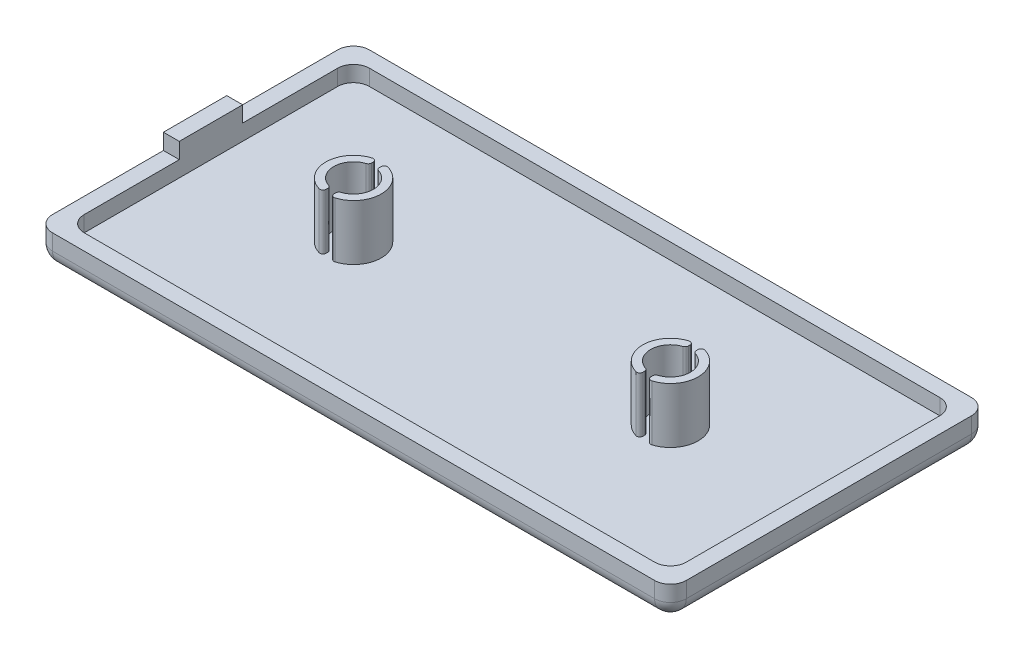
ISO-10303-21;
HEADER;
FILE_DESCRIPTION(('STEP AP214'),'2;1');
FILE_NAME('part.step','',(''),(''),'','','');
FILE_SCHEMA(('AUTOMOTIVE_DESIGN { 1 0 10303 214 1 1 1 1 }'));
ENDSEC;
DATA;
#1=APPLICATION_CONTEXT('core data for automotive mechanical design processes');
#2=APPLICATION_PROTOCOL_DEFINITION('international standard','automotive_design',2000,#1);
#3=PRODUCT_CONTEXT('',#1,'mechanical');
#4=PRODUCT('Part','Part','',(#3));
#5=PRODUCT_RELATED_PRODUCT_CATEGORY('part','',(#4));
#6=PRODUCT_DEFINITION_FORMATION('','',#4);
#7=PRODUCT_DEFINITION_CONTEXT('part definition',#1,'design');
#8=PRODUCT_DEFINITION('design','',#6,#7);
#9=PRODUCT_DEFINITION_SHAPE('','',#8);
#10=(LENGTH_UNIT() NAMED_UNIT(*) SI_UNIT(.MILLI.,.METRE.));
#11=(NAMED_UNIT(*) PLANE_ANGLE_UNIT() SI_UNIT($,.RADIAN.));
#12=(NAMED_UNIT(*) SI_UNIT($,.STERADIAN.) SOLID_ANGLE_UNIT());
#13=UNCERTAINTY_MEASURE_WITH_UNIT(LENGTH_MEASURE(1.E-05),#10,'distance_accuracy_value','');
#14=(GEOMETRIC_REPRESENTATION_CONTEXT(3) GLOBAL_UNCERTAINTY_ASSIGNED_CONTEXT((#13)) GLOBAL_UNIT_ASSIGNED_CONTEXT((#10,
#11,#12)) REPRESENTATION_CONTEXT('',''));
#15=CARTESIAN_POINT('',(0.,0.,0.));
#16=DIRECTION('',(0.,0.,1.));
#17=DIRECTION('',(1.,0.,0.));
#18=AXIS2_PLACEMENT_3D('',#15,#16,#17);
#19=CARTESIAN_POINT('',(0.,2.,0.));
#20=DIRECTION('',(0.,1.,0.));
#21=DIRECTION('',(0.,0.,1.));
#22=AXIS2_PLACEMENT_3D('',#19,#20,#21);
#23=PLANE('',#22);
#24=CARTESIAN_POINT('',(31.4481370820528,2.,7.81232542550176));
#25=DIRECTION('',(0.,-1.,0.));
#26=DIRECTION('',(0.,0.,1.));
#27=AXIS2_PLACEMENT_3D('',#24,#25,#26);
#28=CIRCLE('',#27,2.5);
#29=CARTESIAN_POINT('',(32.2239991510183,2.,5.43576529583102));
#30=VERTEX_POINT('',#29);
#31=CARTESIAN_POINT('',(32.2239991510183,2.,10.1888855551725));
#32=VERTEX_POINT('',#31);
#33=EDGE_CURVE('E1482',#30,#32,#28,.T.);
#34=ORIENTED_EDGE('',*,*,#33,.F.);
#35=CARTESIAN_POINT('',(32.3481370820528,2.,5.05551567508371));
#36=DIRECTION('',(0.,1.,0.));
#37=DIRECTION('',(0.,0.,1.));
#38=AXIS2_PLACEMENT_3D('',#35,#36,#37);
#39=CIRCLE('',#38,0.400000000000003);
#40=CARTESIAN_POINT('',(31.9481370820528,2.,5.05551567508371));
#41=VERTEX_POINT('',#40);
#42=EDGE_CURVE('E1484',#41,#30,#39,.T.);
#43=ORIENTED_EDGE('',*,*,#42,.F.);
#44=DIRECTION('',(0.,0.,1.));
#45=VECTOR('',#44,1.);
#46=CARTESIAN_POINT('',(31.9481370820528,2.,5.05551567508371));
#47=LINE('',#46,#45);
#48=CARTESIAN_POINT('',(31.9481370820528,2.,4.84584603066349));
#49=VERTEX_POINT('',#48);
#50=EDGE_CURVE('E1468',#49,#41,#47,.T.);
#51=ORIENTED_EDGE('',*,*,#50,.F.);
#52=CARTESIAN_POINT('',(32.3481370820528,2.,4.84584603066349));
#53=DIRECTION('',(0.,1.,0.));
#54=DIRECTION('',(0.,0.,-1.));
#55=AXIS2_PLACEMENT_3D('',#52,#53,#54);
#56=CIRCLE('',#55,0.400000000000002);
#57=CARTESIAN_POINT('',(32.4642661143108,2.,4.46307449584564));
#58=VERTEX_POINT('',#57);
#59=EDGE_CURVE('E1471',#58,#49,#56,.T.);
#60=ORIENTED_EDGE('',*,*,#59,.F.);
#61=CARTESIAN_POINT('',(31.4481370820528,2.,7.81232542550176));
#62=DIRECTION('',(0.,1.,0.));
#63=DIRECTION('',(0.,0.,1.));
#64=AXIS2_PLACEMENT_3D('',#61,#62,#63);
#65=CIRCLE('',#64,3.5);
#66=CARTESIAN_POINT('',(32.4642661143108,2.,11.1615763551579));
#67=VERTEX_POINT('',#66);
#68=EDGE_CURVE('E1474',#67,#58,#65,.T.);
#69=ORIENTED_EDGE('',*,*,#68,.F.);
#70=CARTESIAN_POINT('',(32.3481370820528,2.,10.77880482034));
#71=DIRECTION('',(0.,1.,0.));
#72=DIRECTION('',(0.,0.,1.));
#73=AXIS2_PLACEMENT_3D('',#70,#71,#72);
#74=CIRCLE('',#73,0.399999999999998);
#75=CARTESIAN_POINT('',(31.9481370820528,2.,10.77880482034));
#76=VERTEX_POINT('',#75);
#77=EDGE_CURVE('E1476',#76,#67,#74,.T.);
#78=ORIENTED_EDGE('',*,*,#77,.F.);
#79=DIRECTION('',(0.,0.,1.));
#80=VECTOR('',#79,1.);
#81=CARTESIAN_POINT('',(31.9481370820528,2.,10.5691351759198));
#82=LINE('',#81,#80);
#83=CARTESIAN_POINT('',(31.9481370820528,2.,10.5691351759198));
#84=VERTEX_POINT('',#83);
#85=EDGE_CURVE('E1478',#84,#76,#82,.T.);
#86=ORIENTED_EDGE('',*,*,#85,.F.);
#87=CARTESIAN_POINT('',(32.3481370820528,2.,10.5691351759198));
#88=DIRECTION('',(0.,1.,0.));
#89=DIRECTION('',(0.,0.,-1.));
#90=AXIS2_PLACEMENT_3D('',#87,#88,#89);
#91=CIRCLE('',#90,0.399999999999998);
#92=EDGE_CURVE('E1480',#32,#84,#91,.T.);
#93=ORIENTED_EDGE('',*,*,#92,.F.);
#94=EDGE_LOOP('',(#34,#43,#51,#60,#69,#78,#86,#93));
#95=FACE_BOUND('',#94,.T.);
#96=CARTESIAN_POINT('',(-8.55186291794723,2.,7.81232542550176));
#97=DIRECTION('',(0.,-1.,0.));
#98=DIRECTION('',(0.,0.,1.));
#99=AXIS2_PLACEMENT_3D('',#96,#97,#98);
#100=CIRCLE('',#99,2.5);
#101=CARTESIAN_POINT('',(-7.77600084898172,2.,5.43576529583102));
#102=VERTEX_POINT('',#101);
#103=CARTESIAN_POINT('',(-7.7760008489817,2.,10.1888855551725));
#104=VERTEX_POINT('',#103);
#105=EDGE_CURVE('E1320',#102,#104,#100,.T.);
#106=ORIENTED_EDGE('',*,*,#105,.F.);
#107=CARTESIAN_POINT('',(-7.65186291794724,2.,5.05551567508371));
#108=DIRECTION('',(0.,1.,0.));
#109=DIRECTION('',(0.,0.,1.));
#110=AXIS2_PLACEMENT_3D('',#107,#108,#109);
#111=CIRCLE('',#110,0.400000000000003);
#112=CARTESIAN_POINT('',(-8.05186291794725,2.,5.05551567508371));
#113=VERTEX_POINT('',#112);
#114=EDGE_CURVE('E1314',#113,#102,#111,.T.);
#115=ORIENTED_EDGE('',*,*,#114,.F.);
#116=DIRECTION('',(0.,0.,1.));
#117=VECTOR('',#116,1.);
#118=CARTESIAN_POINT('',(-8.05186291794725,2.,5.05551567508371));
#119=LINE('',#118,#117);
#120=CARTESIAN_POINT('',(-8.05186291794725,2.,4.84584603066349));
#121=VERTEX_POINT('',#120);
#122=EDGE_CURVE('E1341',#121,#113,#119,.T.);
#123=ORIENTED_EDGE('',*,*,#122,.F.);
#124=CARTESIAN_POINT('',(-7.65186291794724,2.,4.84584603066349));
#125=DIRECTION('',(0.,1.,0.));
#126=DIRECTION('',(0.,0.,-1.));
#127=AXIS2_PLACEMENT_3D('',#124,#125,#126);
#128=CIRCLE('',#127,0.400000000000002);
#129=CARTESIAN_POINT('',(-7.53573388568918,2.,4.46307449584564));
#130=VERTEX_POINT('',#129);
#131=EDGE_CURVE('E1338',#130,#121,#128,.T.);
#132=ORIENTED_EDGE('',*,*,#131,.F.);
#133=CARTESIAN_POINT('',(-8.55186291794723,2.,7.81232542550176));
#134=DIRECTION('',(0.,1.,0.));
#135=DIRECTION('',(0.,0.,1.));
#136=AXIS2_PLACEMENT_3D('',#133,#134,#135);
#137=CIRCLE('',#136,3.5);
#138=CARTESIAN_POINT('',(-7.53573388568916,2.,11.1615763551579));
#139=VERTEX_POINT('',#138);
#140=EDGE_CURVE('E1336',#139,#130,#137,.T.);
#141=ORIENTED_EDGE('',*,*,#140,.F.);
#142=CARTESIAN_POINT('',(-7.65186291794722,2.,10.77880482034));
#143=DIRECTION('',(0.,1.,0.));
#144=DIRECTION('',(0.,0.,1.));
#145=AXIS2_PLACEMENT_3D('',#142,#143,#144);
#146=CIRCLE('',#145,0.399999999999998);
#147=CARTESIAN_POINT('',(-8.05186291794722,2.,10.77880482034));
#148=VERTEX_POINT('',#147);
#149=EDGE_CURVE('E1334',#148,#139,#146,.T.);
#150=ORIENTED_EDGE('',*,*,#149,.F.);
#151=DIRECTION('',(0.,0.,1.));
#152=VECTOR('',#151,1.);
#153=CARTESIAN_POINT('',(-8.05186291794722,2.,10.5691351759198));
#154=LINE('',#153,#152);
#155=CARTESIAN_POINT('',(-8.05186291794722,2.,10.5691351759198));
#156=VERTEX_POINT('',#155);
#157=EDGE_CURVE('E1329',#156,#148,#154,.T.);
#158=ORIENTED_EDGE('',*,*,#157,.F.);
#159=CARTESIAN_POINT('',(-7.65186291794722,2.,10.5691351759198));
#160=DIRECTION('',(0.,1.,0.));
#161=DIRECTION('',(0.,0.,-1.));
#162=AXIS2_PLACEMENT_3D('',#159,#160,#161);
#163=CIRCLE('',#162,0.399999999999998);
#164=EDGE_CURVE('E1325',#104,#156,#163,.T.);
#165=ORIENTED_EDGE('',*,*,#164,.F.);
#166=EDGE_LOOP('',(#106,#115,#123,#132,#141,#150,#158,#165));
#167=FACE_BOUND('',#166,.T.);
#168=DIRECTION('',(1.,0.,0.));
#169=VECTOR('',#168,1.);
#170=CARTESIAN_POINT('',(0.,2.,-10.1864929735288));
#171=LINE('',#170,#169);
#172=CARTESIAN_POINT('',(-24.5518629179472,2.,-10.1864929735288));
#173=VERTEX_POINT('',#172);
#174=CARTESIAN_POINT('',(47.4481370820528,2.,-10.1864929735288));
#175=VERTEX_POINT('',#174);
#176=EDGE_CURVE('E582',#173,#175,#171,.T.);
#177=ORIENTED_EDGE('',*,*,#176,.F.);
#178=CARTESIAN_POINT('',(-24.5518629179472,2.,-8.18649297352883));
#179=DIRECTION('',(0.,1.,0.));
#180=DIRECTION('',(0.,0.,1.));
#181=AXIS2_PLACEMENT_3D('',#178,#179,#180);
#182=CIRCLE('',#181,2.);
#183=CARTESIAN_POINT('',(-26.5518629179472,2.,-8.18649297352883));
#184=VERTEX_POINT('',#183);
#185=EDGE_CURVE('E477',#173,#184,#182,.T.);
#186=ORIENTED_EDGE('',*,*,#185,.T.);
#187=DIRECTION('',(0.,0.,1.));
#188=VECTOR('',#187,1.);
#189=CARTESIAN_POINT('',(-26.5518629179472,2.,0.));
#190=LINE('',#189,#188);
#191=CARTESIAN_POINT('',(-26.5518629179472,2.,23.8123254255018));
#192=VERTEX_POINT('',#191);
#193=EDGE_CURVE('E588',#184,#192,#190,.T.);
#194=ORIENTED_EDGE('',*,*,#193,.T.);
#195=CARTESIAN_POINT('',(-24.5518629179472,2.,23.8123254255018));
#196=DIRECTION('',(0.,1.,0.));
#197=DIRECTION('',(0.,0.,1.));
#198=AXIS2_PLACEMENT_3D('',#195,#196,#197);
#199=CIRCLE('',#198,2.);
#200=CARTESIAN_POINT('',(-24.5518629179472,2.,25.8123254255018));
#201=VERTEX_POINT('',#200);
#202=EDGE_CURVE('E471',#192,#201,#199,.T.);
#203=ORIENTED_EDGE('',*,*,#202,.T.);
#204=DIRECTION('',(1.,0.,0.));
#205=VECTOR('',#204,1.);
#206=CARTESIAN_POINT('',(0.,2.,25.8123254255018));
#207=LINE('',#206,#205);
#208=CARTESIAN_POINT('',(47.4481370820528,2.,25.8123254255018));
#209=VERTEX_POINT('',#208);
#210=EDGE_CURVE('E595',#201,#209,#207,.T.);
#211=ORIENTED_EDGE('',*,*,#210,.T.);
#212=CARTESIAN_POINT('',(47.4481370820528,2.,23.8123254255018));
#213=DIRECTION('',(0.,1.,0.));
#214=DIRECTION('',(0.,0.,1.));
#215=AXIS2_PLACEMENT_3D('',#212,#213,#214);
#216=CIRCLE('',#215,2.);
#217=CARTESIAN_POINT('',(49.4481370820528,2.,23.8123254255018));
#218=VERTEX_POINT('',#217);
#219=EDGE_CURVE('E473',#209,#218,#216,.T.);
#220=ORIENTED_EDGE('',*,*,#219,.T.);
#221=DIRECTION('',(0.,0.,1.));
#222=VECTOR('',#221,1.);
#223=CARTESIAN_POINT('',(49.4481370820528,2.,0.));
#224=LINE('',#223,#222);
#225=CARTESIAN_POINT('',(49.4481370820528,2.,-8.18649297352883));
#226=VERTEX_POINT('',#225);
#227=EDGE_CURVE('E577',#226,#218,#224,.T.);
#228=ORIENTED_EDGE('',*,*,#227,.F.);
#229=CARTESIAN_POINT('',(47.4481370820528,2.,-8.18649297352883));
#230=DIRECTION('',(0.,1.,0.));
#231=DIRECTION('',(0.,0.,1.));
#232=AXIS2_PLACEMENT_3D('',#229,#230,#231);
#233=CIRCLE('',#232,2.);
#234=EDGE_CURVE('E475',#226,#175,#233,.T.);
#235=ORIENTED_EDGE('',*,*,#234,.T.);
#236=EDGE_LOOP('',(#177,#186,#194,#203,#211,#220,#228,#235));
#237=FACE_BOUND('',#236,.T.);
#238=DIRECTION('',(0.,0.,-1.));
#239=VECTOR('',#238,1.);
#240=CARTESIAN_POINT('',(-9.05186291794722,2.,10.5691351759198));
#241=LINE('',#240,#239);
#242=CARTESIAN_POINT('',(-9.05186291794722,2.,10.77880482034));
#243=VERTEX_POINT('',#242);
#244=CARTESIAN_POINT('',(-9.05186291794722,2.,10.5691351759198));
#245=VERTEX_POINT('',#244);
#246=EDGE_CURVE('E1425',#243,#245,#241,.T.);
#247=ORIENTED_EDGE('',*,*,#246,.F.);
#248=CARTESIAN_POINT('',(-9.45186291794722,2.,10.77880482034));
#249=DIRECTION('',(0.,1.,0.));
#250=DIRECTION('',(0.,0.,-1.));
#251=AXIS2_PLACEMENT_3D('',#248,#249,#250);
#252=CIRCLE('',#251,0.400000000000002);
#253=CARTESIAN_POINT('',(-9.56799195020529,2.,11.1615763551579));
#254=VERTEX_POINT('',#253);
#255=EDGE_CURVE('E1427',#254,#243,#252,.T.);
#256=ORIENTED_EDGE('',*,*,#255,.F.);
#257=CARTESIAN_POINT('',(-8.55186291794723,2.,7.81232542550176));
#258=DIRECTION('',(0.,1.,0.));
#259=DIRECTION('',(0.,0.,1.));
#260=AXIS2_PLACEMENT_3D('',#257,#258,#259);
#261=CIRCLE('',#260,3.5);
#262=CARTESIAN_POINT('',(-9.56799195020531,2.,4.46307449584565));
#263=VERTEX_POINT('',#262);
#264=EDGE_CURVE('E1411',#263,#254,#261,.T.);
#265=ORIENTED_EDGE('',*,*,#264,.F.);
#266=CARTESIAN_POINT('',(-9.45186291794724,2.,4.8458460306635));
#267=DIRECTION('',(0.,1.,0.));
#268=DIRECTION('',(0.,0.,1.));
#269=AXIS2_PLACEMENT_3D('',#266,#267,#268);
#270=CIRCLE('',#269,0.400000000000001);
#271=CARTESIAN_POINT('',(-9.05186291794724,2.,4.8458460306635));
#272=VERTEX_POINT('',#271);
#273=EDGE_CURVE('E1414',#272,#263,#270,.T.);
#274=ORIENTED_EDGE('',*,*,#273,.F.);
#275=DIRECTION('',(0.,0.,-1.));
#276=VECTOR('',#275,1.);
#277=CARTESIAN_POINT('',(-9.05186291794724,2.,5.05551567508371));
#278=LINE('',#277,#276);
#279=CARTESIAN_POINT('',(-9.05186291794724,2.,5.05551567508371));
#280=VERTEX_POINT('',#279);
#281=EDGE_CURVE('E1417',#280,#272,#278,.T.);
#282=ORIENTED_EDGE('',*,*,#281,.F.);
#283=CARTESIAN_POINT('',(-9.45186291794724,2.,5.05551567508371));
#284=DIRECTION('',(0.,1.,0.));
#285=DIRECTION('',(0.,0.,1.));
#286=AXIS2_PLACEMENT_3D('',#283,#284,#285);
#287=CIRCLE('',#286,0.400000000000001);
#288=CARTESIAN_POINT('',(-9.32772498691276,2.,5.43576529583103));
#289=VERTEX_POINT('',#288);
#290=EDGE_CURVE('E1419',#289,#280,#287,.T.);
#291=ORIENTED_EDGE('',*,*,#290,.F.);
#292=CARTESIAN_POINT('',(-8.55186291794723,2.,7.81232542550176));
#293=DIRECTION('',(0.,-1.,0.));
#294=DIRECTION('',(0.,0.,1.));
#295=AXIS2_PLACEMENT_3D('',#292,#293,#294);
#296=CIRCLE('',#295,2.5);
#297=CARTESIAN_POINT('',(-9.32772498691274,2.,10.1888855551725));
#298=VERTEX_POINT('',#297);
#299=EDGE_CURVE('E1421',#298,#289,#296,.T.);
#300=ORIENTED_EDGE('',*,*,#299,.F.);
#301=CARTESIAN_POINT('',(-9.45186291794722,2.,10.5691351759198));
#302=DIRECTION('',(0.,1.,0.));
#303=DIRECTION('',(0.,0.,1.));
#304=AXIS2_PLACEMENT_3D('',#301,#302,#303);
#305=CIRCLE('',#304,0.400000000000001);
#306=EDGE_CURVE('E1423',#245,#298,#305,.T.);
#307=ORIENTED_EDGE('',*,*,#306,.F.);
#308=EDGE_LOOP('',(#247,#256,#265,#274,#282,#291,#300,#307));
#309=FACE_BOUND('',#308,.T.);
#310=DIRECTION('',(0.,0.,-1.));
#311=VECTOR('',#310,1.);
#312=CARTESIAN_POINT('',(30.9481370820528,2.,10.5691351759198));
#313=LINE('',#312,#311);
#314=CARTESIAN_POINT('',(30.9481370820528,2.,10.77880482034));
#315=VERTEX_POINT('',#314);
#316=CARTESIAN_POINT('',(30.9481370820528,2.,10.5691351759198));
#317=VERTEX_POINT('',#316);
#318=EDGE_CURVE('E1537',#315,#317,#313,.T.);
#319=ORIENTED_EDGE('',*,*,#318,.F.);
#320=CARTESIAN_POINT('',(30.5481370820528,2.,10.77880482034));
#321=DIRECTION('',(0.,1.,0.));
#322=DIRECTION('',(0.,0.,-1.));
#323=AXIS2_PLACEMENT_3D('',#320,#321,#322);
#324=CIRCLE('',#323,0.400000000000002);
#325=CARTESIAN_POINT('',(30.4320080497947,2.,11.1615763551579));
#326=VERTEX_POINT('',#325);
#327=EDGE_CURVE('E415',#326,#315,#324,.T.);
#328=ORIENTED_EDGE('',*,*,#327,.F.);
#329=CARTESIAN_POINT('',(31.4481370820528,2.,7.81232542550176));
#330=DIRECTION('',(0.,1.,0.));
#331=DIRECTION('',(0.,0.,1.));
#332=AXIS2_PLACEMENT_3D('',#329,#330,#331);
#333=CIRCLE('',#332,3.5);
#334=CARTESIAN_POINT('',(30.4320080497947,2.,4.46307449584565));
#335=VERTEX_POINT('',#334);
#336=EDGE_CURVE('E1524',#335,#326,#333,.T.);
#337=ORIENTED_EDGE('',*,*,#336,.F.);
#338=CARTESIAN_POINT('',(30.5481370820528,2.,4.8458460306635));
#339=DIRECTION('',(0.,1.,0.));
#340=DIRECTION('',(0.,0.,1.));
#341=AXIS2_PLACEMENT_3D('',#338,#339,#340);
#342=CIRCLE('',#341,0.400000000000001);
#343=CARTESIAN_POINT('',(30.9481370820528,2.,4.8458460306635));
#344=VERTEX_POINT('',#343);
#345=EDGE_CURVE('E1527',#344,#335,#342,.T.);
#346=ORIENTED_EDGE('',*,*,#345,.F.);
#347=DIRECTION('',(0.,0.,-1.));
#348=VECTOR('',#347,1.);
#349=CARTESIAN_POINT('',(30.9481370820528,2.,5.05551567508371));
#350=LINE('',#349,#348);
#351=CARTESIAN_POINT('',(30.9481370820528,2.,5.05551567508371));
#352=VERTEX_POINT('',#351);
#353=EDGE_CURVE('E1529',#352,#344,#350,.T.);
#354=ORIENTED_EDGE('',*,*,#353,.F.);
#355=CARTESIAN_POINT('',(30.5481370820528,2.,5.05551567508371));
#356=DIRECTION('',(0.,1.,0.));
#357=DIRECTION('',(0.,0.,1.));
#358=AXIS2_PLACEMENT_3D('',#355,#356,#357);
#359=CIRCLE('',#358,0.400000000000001);
#360=CARTESIAN_POINT('',(30.6722750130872,2.,5.43576529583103));
#361=VERTEX_POINT('',#360);
#362=EDGE_CURVE('E1531',#361,#352,#359,.T.);
#363=ORIENTED_EDGE('',*,*,#362,.F.);
#364=CARTESIAN_POINT('',(31.4481370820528,2.,7.81232542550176));
#365=DIRECTION('',(0.,-1.,0.));
#366=DIRECTION('',(0.,0.,1.));
#367=AXIS2_PLACEMENT_3D('',#364,#365,#366);
#368=CIRCLE('',#367,2.5);
#369=CARTESIAN_POINT('',(30.6722750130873,2.,10.1888855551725));
#370=VERTEX_POINT('',#369);
#371=EDGE_CURVE('E1533',#370,#361,#368,.T.);
#372=ORIENTED_EDGE('',*,*,#371,.F.);
#373=CARTESIAN_POINT('',(30.5481370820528,2.,10.5691351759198));
#374=DIRECTION('',(0.,1.,0.));
#375=DIRECTION('',(0.,0.,1.));
#376=AXIS2_PLACEMENT_3D('',#373,#374,#375);
#377=CIRCLE('',#376,0.400000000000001);
#378=EDGE_CURVE('E1535',#317,#370,#377,.T.);
#379=ORIENTED_EDGE('',*,*,#378,.F.);
#380=EDGE_LOOP('',(#319,#328,#337,#346,#354,#363,#372,#379));
#381=FACE_BOUND('',#380,.T.);
#382=ADVANCED_FACE('F40',(#95,#167,#237,#309,#381),#23,.T.);
#383=CARTESIAN_POINT('',(0.,4.,0.));
#384=DIRECTION('',(0.,1.,0.));
#385=DIRECTION('',(0.,0.,1.));
#386=AXIS2_PLACEMENT_3D('',#383,#384,#385);
#387=PLANE('',#386);
#388=DIRECTION('',(-1.,0.,0.));
#389=VECTOR('',#388,1.);
#390=CARTESIAN_POINT('',(-26.5518629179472,4.,3.81232542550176));
#391=LINE('',#390,#389);
#392=CARTESIAN_POINT('',(-26.5518629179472,4.,3.81232542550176));
#393=VERTEX_POINT('',#392);
#394=CARTESIAN_POINT('',(-28.5518629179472,4.,3.81232542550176));
#395=VERTEX_POINT('',#394);
#396=EDGE_CURVE('E394',#393,#395,#391,.T.);
#397=ORIENTED_EDGE('',*,*,#396,.F.);
#398=DIRECTION('',(0.,0.,1.));
#399=VECTOR('',#398,1.);
#400=CARTESIAN_POINT('',(-26.5518629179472,4.,-10.1864929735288));
#401=LINE('',#400,#399);
#402=CARTESIAN_POINT('',(-26.5518629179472,4.,-8.18649297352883));
#403=VERTEX_POINT('',#402);
#404=EDGE_CURVE('E404',#403,#393,#401,.T.);
#405=ORIENTED_EDGE('',*,*,#404,.F.);
#406=CARTESIAN_POINT('',(-24.5518629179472,4.,-8.18649297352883));
#407=DIRECTION('',(0.,1.,0.));
#408=DIRECTION('',(0.,0.,1.));
#409=AXIS2_PLACEMENT_3D('',#406,#407,#408);
#410=CIRCLE('',#409,2.);
#411=CARTESIAN_POINT('',(-24.5518629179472,4.,-10.1864929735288));
#412=VERTEX_POINT('',#411);
#413=EDGE_CURVE('E521',#403,#412,#410,.F.);
#414=ORIENTED_EDGE('',*,*,#413,.T.);
#415=DIRECTION('',(-1.,0.,0.));
#416=VECTOR('',#415,1.);
#417=CARTESIAN_POINT('',(-26.5518629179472,4.,-10.1864929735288));
#418=LINE('',#417,#416);
#419=CARTESIAN_POINT('',(47.4481370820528,4.,-10.1864929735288));
#420=VERTEX_POINT('',#419);
#421=EDGE_CURVE('E451',#420,#412,#418,.T.);
#422=ORIENTED_EDGE('',*,*,#421,.F.);
#423=CARTESIAN_POINT('',(47.4481370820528,4.,-8.18649297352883));
#424=DIRECTION('',(0.,1.,0.));
#425=DIRECTION('',(0.,0.,1.));
#426=AXIS2_PLACEMENT_3D('',#423,#424,#425);
#427=CIRCLE('',#426,2.);
#428=CARTESIAN_POINT('',(49.4481370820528,4.,-8.18649297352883));
#429=VERTEX_POINT('',#428);
#430=EDGE_CURVE('E523',#420,#429,#427,.F.);
#431=ORIENTED_EDGE('',*,*,#430,.T.);
#432=DIRECTION('',(0.,0.,-1.));
#433=VECTOR('',#432,1.);
#434=CARTESIAN_POINT('',(49.4481370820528,4.,-10.1864929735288));
#435=LINE('',#434,#433);
#436=CARTESIAN_POINT('',(49.4481370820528,4.,23.8123254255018));
#437=VERTEX_POINT('',#436);
#438=EDGE_CURVE('E602',#437,#429,#435,.T.);
#439=ORIENTED_EDGE('',*,*,#438,.F.);
#440=CARTESIAN_POINT('',(47.4481370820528,4.,23.8123254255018));
#441=DIRECTION('',(0.,1.,0.));
#442=DIRECTION('',(0.,0.,1.));
#443=AXIS2_PLACEMENT_3D('',#440,#441,#442);
#444=CIRCLE('',#443,2.);
#445=CARTESIAN_POINT('',(47.4481370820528,4.,25.8123254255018));
#446=VERTEX_POINT('',#445);
#447=EDGE_CURVE('E525',#437,#446,#444,.F.);
#448=ORIENTED_EDGE('',*,*,#447,.T.);
#449=DIRECTION('',(1.,0.,0.));
#450=VECTOR('',#449,1.);
#451=CARTESIAN_POINT('',(-26.5518629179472,4.,25.8123254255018));
#452=LINE('',#451,#450);
#453=CARTESIAN_POINT('',(-24.5518629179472,4.,25.8123254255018));
#454=VERTEX_POINT('',#453);
#455=EDGE_CURVE('E599',#454,#446,#452,.T.);
#456=ORIENTED_EDGE('',*,*,#455,.F.);
#457=CARTESIAN_POINT('',(-24.5518629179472,4.,23.8123254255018));
#458=DIRECTION('',(0.,1.,0.));
#459=DIRECTION('',(0.,0.,1.));
#460=AXIS2_PLACEMENT_3D('',#457,#458,#459);
#461=CIRCLE('',#460,2.);
#462=CARTESIAN_POINT('',(-26.5518629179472,4.,23.8123254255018));
#463=VERTEX_POINT('',#462);
#464=EDGE_CURVE('E527',#454,#463,#461,.F.);
#465=ORIENTED_EDGE('',*,*,#464,.T.);
#466=CARTESIAN_POINT('',(-26.5518629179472,4.,11.8123254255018));
#467=VERTEX_POINT('',#466);
#468=EDGE_CURVE('E422',#467,#463,#401,.T.);
#469=ORIENTED_EDGE('',*,*,#468,.F.);
#470=DIRECTION('',(-1.,0.,0.));
#471=VECTOR('',#470,1.);
#472=CARTESIAN_POINT('',(-26.5518629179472,4.,11.8123254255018));
#473=LINE('',#472,#471);
#474=CARTESIAN_POINT('',(-28.5518629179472,4.,11.8123254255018));
#475=VERTEX_POINT('',#474);
#476=EDGE_CURVE('E416',#467,#475,#473,.T.);
#477=ORIENTED_EDGE('',*,*,#476,.T.);
#478=DIRECTION('',(0.,0.,1.));
#479=VECTOR('',#478,1.);
#480=CARTESIAN_POINT('',(-28.5518629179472,4.,-12.1876745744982));
#481=LINE('',#480,#479);
#482=CARTESIAN_POINT('',(-28.5518629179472,4.,25.8123254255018));
#483=VERTEX_POINT('',#482);
#484=EDGE_CURVE('E446',#475,#483,#481,.T.);
#485=ORIENTED_EDGE('',*,*,#484,.T.);
#486=CARTESIAN_POINT('',(-26.5518629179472,4.,25.8123254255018));
#487=DIRECTION('',(0.,1.,0.));
#488=DIRECTION('',(0.,0.,1.));
#489=AXIS2_PLACEMENT_3D('',#486,#487,#488);
#490=CIRCLE('',#489,2.);
#491=CARTESIAN_POINT('',(-26.5518629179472,4.,27.8123254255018));
#492=VERTEX_POINT('',#491);
#493=EDGE_CURVE('E506',#483,#492,#490,.T.);
#494=ORIENTED_EDGE('',*,*,#493,.T.);
#495=DIRECTION('',(1.,0.,0.));
#496=VECTOR('',#495,1.);
#497=CARTESIAN_POINT('',(-28.5518629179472,4.,27.8123254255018));
#498=LINE('',#497,#496);
#499=CARTESIAN_POINT('',(49.4481370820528,4.,27.8123254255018));
#500=VERTEX_POINT('',#499);
#501=EDGE_CURVE('E445',#492,#500,#498,.T.);
#502=ORIENTED_EDGE('',*,*,#501,.T.);
#503=CARTESIAN_POINT('',(49.4481370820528,4.,25.8123254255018));
#504=DIRECTION('',(0.,1.,0.));
#505=DIRECTION('',(0.,0.,1.));
#506=AXIS2_PLACEMENT_3D('',#503,#504,#505);
#507=CIRCLE('',#506,2.);
#508=CARTESIAN_POINT('',(51.4481370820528,4.,25.8123254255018));
#509=VERTEX_POINT('',#508);
#510=EDGE_CURVE('E504',#500,#509,#507,.T.);
#511=ORIENTED_EDGE('',*,*,#510,.T.);
#512=DIRECTION('',(0.,0.,-1.));
#513=VECTOR('',#512,1.);
#514=CARTESIAN_POINT('',(51.4481370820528,4.,-12.1876745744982));
#515=LINE('',#514,#513);
#516=CARTESIAN_POINT('',(51.4481370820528,4.,-10.1876745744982));
#517=VERTEX_POINT('',#516);
#518=EDGE_CURVE('E449',#509,#517,#515,.T.);
#519=ORIENTED_EDGE('',*,*,#518,.T.);
#520=CARTESIAN_POINT('',(49.4481370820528,4.,-10.1876745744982));
#521=DIRECTION('',(0.,1.,0.));
#522=DIRECTION('',(0.,0.,1.));
#523=AXIS2_PLACEMENT_3D('',#520,#521,#522);
#524=CIRCLE('',#523,2.);
#525=CARTESIAN_POINT('',(49.4481370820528,4.,-12.1876745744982));
#526=VERTEX_POINT('',#525);
#527=EDGE_CURVE('E508',#517,#526,#524,.T.);
#528=ORIENTED_EDGE('',*,*,#527,.T.);
#529=DIRECTION('',(-1.,0.,0.));
#530=VECTOR('',#529,1.);
#531=CARTESIAN_POINT('',(-28.5518629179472,4.,-12.1876745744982));
#532=LINE('',#531,#530);
#533=CARTESIAN_POINT('',(-26.5518629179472,4.,-12.1876745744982));
#534=VERTEX_POINT('',#533);
#535=EDGE_CURVE('E464',#526,#534,#532,.T.);
#536=ORIENTED_EDGE('',*,*,#535,.T.);
#537=CARTESIAN_POINT('',(-26.5518629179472,4.,-10.1876745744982));
#538=DIRECTION('',(0.,1.,0.));
#539=DIRECTION('',(0.,0.,1.));
#540=AXIS2_PLACEMENT_3D('',#537,#538,#539);
#541=CIRCLE('',#540,2.);
#542=CARTESIAN_POINT('',(-28.5518629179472,4.,-10.1876745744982));
#543=VERTEX_POINT('',#542);
#544=EDGE_CURVE('E444',#534,#543,#541,.T.);
#545=ORIENTED_EDGE('',*,*,#544,.T.);
#546=EDGE_CURVE('E438',#543,#395,#481,.T.);
#547=ORIENTED_EDGE('',*,*,#546,.T.);
#548=EDGE_LOOP('',(#397,#405,#414,#422,#431,#439,#448,#456,#465,#469,#477,#485,#494,#502,#511,
#519,#528,#536,#545,#547));
#549=FACE_BOUND('',#548,.T.);
#550=ADVANCED_FACE('F441',(#549),#387,.T.);
#551=CARTESIAN_POINT('',(0.,0.,0.));
#552=DIRECTION('',(0.,1.,0.));
#553=DIRECTION('',(0.,0.,1.));
#554=AXIS2_PLACEMENT_3D('',#551,#552,#553);
#555=PLANE('',#554);
#556=DIRECTION('',(0.,0.,-1.));
#557=VECTOR('',#556,1.);
#558=CARTESIAN_POINT('',(49.4481370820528,0.,0.));
#559=LINE('',#558,#557);
#560=CARTESIAN_POINT('',(49.4481370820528,0.,-10.1876745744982));
#561=VERTEX_POINT('',#560);
#562=CARTESIAN_POINT('',(49.4481370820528,0.,25.8123254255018));
#563=VERTEX_POINT('',#562);
#564=EDGE_CURVE('E539',#561,#563,#559,.F.);
#565=ORIENTED_EDGE('',*,*,#564,.T.);
#566=DIRECTION('',(1.,0.,0.));
#567=VECTOR('',#566,1.);
#568=CARTESIAN_POINT('',(0.,0.,25.8123254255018));
#569=LINE('',#568,#567);
#570=CARTESIAN_POINT('',(-26.5518629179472,0.,25.8123254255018));
#571=VERTEX_POINT('',#570);
#572=EDGE_CURVE('E541',#563,#571,#569,.F.);
#573=ORIENTED_EDGE('',*,*,#572,.T.);
#574=DIRECTION('',(0.,0.,1.));
#575=VECTOR('',#574,1.);
#576=CARTESIAN_POINT('',(-26.5518629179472,0.,0.));
#577=LINE('',#576,#575);
#578=CARTESIAN_POINT('',(-26.5518629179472,0.,-10.1876745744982));
#579=VERTEX_POINT('',#578);
#580=EDGE_CURVE('E535',#571,#579,#577,.F.);
#581=ORIENTED_EDGE('',*,*,#580,.T.);
#582=DIRECTION('',(-1.,0.,0.));
#583=VECTOR('',#582,1.);
#584=CARTESIAN_POINT('',(0.,0.,-10.1876745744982));
#585=LINE('',#584,#583);
#586=EDGE_CURVE('E537',#579,#561,#585,.F.);
#587=ORIENTED_EDGE('',*,*,#586,.T.);
#588=EDGE_LOOP('',(#565,#573,#581,#587));
#589=FACE_BOUND('',#588,.T.);
#590=ADVANCED_FACE('F652',(#589),#555,.F.);
#591=CARTESIAN_POINT('',(-28.5518629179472,4.,-12.1876745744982));
#592=DIRECTION('',(1.,0.,0.));
#593=DIRECTION('',(0.,0.,-1.));
#594=AXIS2_PLACEMENT_3D('',#591,#592,#593);
#595=PLANE('',#594);
#596=DIRECTION('',(0.,-1.,0.));
#597=VECTOR('',#596,1.);
#598=CARTESIAN_POINT('',(-28.5518629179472,4.,-10.1876745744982));
#599=LINE('',#598,#597);
#600=CARTESIAN_POINT('',(-28.5518629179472,2.,-10.1876745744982));
#601=VERTEX_POINT('',#600);
#602=EDGE_CURVE('E497',#543,#601,#599,.T.);
#603=ORIENTED_EDGE('',*,*,#602,.T.);
#604=DIRECTION('',(0.,0.,1.));
#605=VECTOR('',#604,1.);
#606=CARTESIAN_POINT('',(-28.5518629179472,2.,-12.1876745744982));
#607=LINE('',#606,#605);
#608=CARTESIAN_POINT('',(-28.5518629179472,2.,25.8123254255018));
#609=VERTEX_POINT('',#608);
#610=EDGE_CURVE('E11',#601,#609,#607,.T.);
#611=ORIENTED_EDGE('',*,*,#610,.T.);
#612=DIRECTION('',(0.,-1.,0.));
#613=VECTOR('',#612,1.);
#614=CARTESIAN_POINT('',(-28.5518629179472,4.,25.8123254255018));
#615=LINE('',#614,#613);
#616=EDGE_CURVE('E494',#609,#483,#615,.F.);
#617=ORIENTED_EDGE('',*,*,#616,.T.);
#618=ORIENTED_EDGE('',*,*,#484,.F.);
#619=DIRECTION('',(0.,-1.,0.));
#620=VECTOR('',#619,1.);
#621=CARTESIAN_POINT('',(-28.5518629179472,0.,11.8123254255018));
#622=LINE('',#621,#620);
#623=CARTESIAN_POINT('',(-28.5518629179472,6.,11.8123254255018));
#624=VERTEX_POINT('',#623);
#625=EDGE_CURVE('E57',#624,#475,#622,.T.);
#626=ORIENTED_EDGE('',*,*,#625,.F.);
#627=DIRECTION('',(0.,0.,-1.));
#628=VECTOR('',#627,1.);
#629=CARTESIAN_POINT('',(-28.5518629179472,6.,0.));
#630=LINE('',#629,#628);
#631=CARTESIAN_POINT('',(-28.5518629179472,6.,3.81232542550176));
#632=VERTEX_POINT('',#631);
#633=EDGE_CURVE('E412',#624,#632,#630,.T.);
#634=ORIENTED_EDGE('',*,*,#633,.T.);
#635=DIRECTION('',(0.,-1.,0.));
#636=VECTOR('',#635,1.);
#637=CARTESIAN_POINT('',(-28.5518629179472,0.,3.81232542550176));
#638=LINE('',#637,#636);
#639=EDGE_CURVE('E389',#632,#395,#638,.T.);
#640=ORIENTED_EDGE('',*,*,#639,.T.);
#641=ORIENTED_EDGE('',*,*,#546,.F.);
#642=EDGE_LOOP('',(#603,#611,#617,#618,#626,#634,#640,#641));
#643=FACE_BOUND('',#642,.T.);
#644=ADVANCED_FACE('F437',(#643),#595,.F.);
#645=CARTESIAN_POINT('',(-28.5518629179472,4.,27.8123254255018));
#646=DIRECTION('',(0.,0.,-1.));
#647=DIRECTION('',(-1.,0.,0.));
#648=AXIS2_PLACEMENT_3D('',#645,#646,#647);
#649=PLANE('',#648);
#650=DIRECTION('',(0.,-1.,0.));
#651=VECTOR('',#650,1.);
#652=CARTESIAN_POINT('',(-26.5518629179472,4.,27.8123254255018));
#653=LINE('',#652,#651);
#654=CARTESIAN_POINT('',(-26.5518629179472,2.,27.8123254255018));
#655=VERTEX_POINT('',#654);
#656=EDGE_CURVE('E518',#492,#655,#653,.T.);
#657=ORIENTED_EDGE('',*,*,#656,.T.);
#658=DIRECTION('',(1.,0.,0.));
#659=VECTOR('',#658,1.);
#660=CARTESIAN_POINT('',(-28.5518629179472,2.,27.8123254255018));
#661=LINE('',#660,#659);
#662=CARTESIAN_POINT('',(49.4481370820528,2.,27.8123254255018));
#663=VERTEX_POINT('',#662);
#664=EDGE_CURVE('E533',#655,#663,#661,.T.);
#665=ORIENTED_EDGE('',*,*,#664,.T.);
#666=DIRECTION('',(0.,-1.,0.));
#667=VECTOR('',#666,1.);
#668=CARTESIAN_POINT('',(49.4481370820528,4.,27.8123254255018));
#669=LINE('',#668,#667);
#670=EDGE_CURVE('E516',#663,#500,#669,.F.);
#671=ORIENTED_EDGE('',*,*,#670,.T.);
#672=ORIENTED_EDGE('',*,*,#501,.F.);
#673=EDGE_LOOP('',(#657,#665,#671,#672));
#674=FACE_BOUND('',#673,.T.);
#675=ADVANCED_FACE('F676',(#674),#649,.F.);
#676=CARTESIAN_POINT('',(51.4481370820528,4.,-12.1876745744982));
#677=DIRECTION('',(-1.,0.,0.));
#678=DIRECTION('',(0.,0.,1.));
#679=AXIS2_PLACEMENT_3D('',#676,#677,#678);
#680=PLANE('',#679);
#681=DIRECTION('',(0.,-1.,0.));
#682=VECTOR('',#681,1.);
#683=CARTESIAN_POINT('',(51.4481370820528,4.,25.8123254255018));
#684=LINE('',#683,#682);
#685=CARTESIAN_POINT('',(51.4481370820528,2.,25.8123254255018));
#686=VERTEX_POINT('',#685);
#687=EDGE_CURVE('E511',#509,#686,#684,.T.);
#688=ORIENTED_EDGE('',*,*,#687,.T.);
#689=DIRECTION('',(0.,0.,-1.));
#690=VECTOR('',#689,1.);
#691=CARTESIAN_POINT('',(51.4481370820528,2.,-12.1876745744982));
#692=LINE('',#691,#690);
#693=CARTESIAN_POINT('',(51.4481370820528,2.,-10.1876745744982));
#694=VERTEX_POINT('',#693);
#695=EDGE_CURVE('E546',#686,#694,#692,.T.);
#696=ORIENTED_EDGE('',*,*,#695,.T.);
#697=DIRECTION('',(0.,-1.,0.));
#698=VECTOR('',#697,1.);
#699=CARTESIAN_POINT('',(51.4481370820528,4.,-10.1876745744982));
#700=LINE('',#699,#698);
#701=EDGE_CURVE('E514',#694,#517,#700,.F.);
#702=ORIENTED_EDGE('',*,*,#701,.T.);
#703=ORIENTED_EDGE('',*,*,#518,.F.);
#704=EDGE_LOOP('',(#688,#696,#702,#703));
#705=FACE_BOUND('',#704,.T.);
#706=ADVANCED_FACE('F672',(#705),#680,.F.);
#707=CARTESIAN_POINT('',(-28.5518629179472,4.,-12.1876745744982));
#708=DIRECTION('',(0.,0.,1.));
#709=DIRECTION('',(1.,0.,0.));
#710=AXIS2_PLACEMENT_3D('',#707,#708,#709);
#711=PLANE('',#710);
#712=DIRECTION('',(0.,-1.,0.));
#713=VECTOR('',#712,1.);
#714=CARTESIAN_POINT('',(49.4481370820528,4.,-12.1876745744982));
#715=LINE('',#714,#713);
#716=CARTESIAN_POINT('',(49.4481370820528,2.,-12.1876745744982));
#717=VERTEX_POINT('',#716);
#718=EDGE_CURVE('E499',#526,#717,#715,.T.);
#719=ORIENTED_EDGE('',*,*,#718,.T.);
#720=DIRECTION('',(-1.,0.,0.));
#721=VECTOR('',#720,1.);
#722=CARTESIAN_POINT('',(-28.5518629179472,2.,-12.1876745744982));
#723=LINE('',#722,#721);
#724=CARTESIAN_POINT('',(-26.5518629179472,2.,-12.1876745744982));
#725=VERTEX_POINT('',#724);
#726=EDGE_CURVE('E550',#717,#725,#723,.T.);
#727=ORIENTED_EDGE('',*,*,#726,.T.);
#728=DIRECTION('',(0.,-1.,0.));
#729=VECTOR('',#728,1.);
#730=CARTESIAN_POINT('',(-26.5518629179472,4.,-12.1876745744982));
#731=LINE('',#730,#729);
#732=EDGE_CURVE('E502',#725,#534,#731,.F.);
#733=ORIENTED_EDGE('',*,*,#732,.T.);
#734=ORIENTED_EDGE('',*,*,#535,.F.);
#735=EDGE_LOOP('',(#719,#727,#733,#734));
#736=FACE_BOUND('',#735,.T.);
#737=ADVANCED_FACE('F665',(#736),#711,.F.);
#738=CARTESIAN_POINT('',(-26.5518629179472,4.,-10.1864929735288));
#739=DIRECTION('',(1.,0.,0.));
#740=DIRECTION('',(0.,0.,-1.));
#741=AXIS2_PLACEMENT_3D('',#738,#739,#740);
#742=PLANE('',#741);
#743=ORIENTED_EDGE('',*,*,#193,.F.);
#744=DIRECTION('',(0.,-1.,0.));
#745=VECTOR('',#744,1.);
#746=CARTESIAN_POINT('',(-26.5518629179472,4.,-8.18649297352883));
#747=LINE('',#746,#745);
#748=EDGE_CURVE('E482',#184,#403,#747,.F.);
#749=ORIENTED_EDGE('',*,*,#748,.T.);
#750=ORIENTED_EDGE('',*,*,#404,.T.);
#751=DIRECTION('',(0.,-1.,0.));
#752=VECTOR('',#751,1.);
#753=CARTESIAN_POINT('',(-26.5518629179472,0.,3.81232542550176));
#754=LINE('',#753,#752);
#755=CARTESIAN_POINT('',(-26.5518629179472,6.,3.81232542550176));
#756=VERTEX_POINT('',#755);
#757=EDGE_CURVE('E386',#756,#393,#754,.T.);
#758=ORIENTED_EDGE('',*,*,#757,.F.);
#759=DIRECTION('',(0.,0.,-1.));
#760=VECTOR('',#759,1.);
#761=CARTESIAN_POINT('',(-26.5518629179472,6.,0.));
#762=LINE('',#761,#760);
#763=CARTESIAN_POINT('',(-26.5518629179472,6.,11.8123254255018));
#764=VERTEX_POINT('',#763);
#765=EDGE_CURVE('E402',#764,#756,#762,.T.);
#766=ORIENTED_EDGE('',*,*,#765,.F.);
#767=DIRECTION('',(0.,-1.,0.));
#768=VECTOR('',#767,1.);
#769=CARTESIAN_POINT('',(-26.5518629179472,0.,11.8123254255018));
#770=LINE('',#769,#768);
#771=EDGE_CURVE('E395',#764,#467,#770,.T.);
#772=ORIENTED_EDGE('',*,*,#771,.T.);
#773=ORIENTED_EDGE('',*,*,#468,.T.);
#774=DIRECTION('',(0.,-1.,0.));
#775=VECTOR('',#774,1.);
#776=CARTESIAN_POINT('',(-26.5518629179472,2.,23.8123254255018));
#777=LINE('',#776,#775);
#778=EDGE_CURVE('E479',#463,#192,#777,.T.);
#779=ORIENTED_EDGE('',*,*,#778,.T.);
#780=EDGE_LOOP('',(#743,#749,#750,#758,#766,#772,#773,#779));
#781=FACE_BOUND('',#780,.T.);
#782=ADVANCED_FACE('F401',(#781),#742,.T.);
#783=CARTESIAN_POINT('',(-26.5518629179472,4.,25.8123254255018));
#784=DIRECTION('',(0.,0.,-1.));
#785=DIRECTION('',(-1.,0.,0.));
#786=AXIS2_PLACEMENT_3D('',#783,#784,#785);
#787=PLANE('',#786);
#788=ORIENTED_EDGE('',*,*,#455,.T.);
#789=DIRECTION('',(0.,-1.,0.));
#790=VECTOR('',#789,1.);
#791=CARTESIAN_POINT('',(47.4481370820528,2.,25.8123254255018));
#792=LINE('',#791,#790);
#793=EDGE_CURVE('E491',#446,#209,#792,.T.);
#794=ORIENTED_EDGE('',*,*,#793,.T.);
#795=ORIENTED_EDGE('',*,*,#210,.F.);
#796=DIRECTION('',(0.,-1.,0.));
#797=VECTOR('',#796,1.);
#798=CARTESIAN_POINT('',(-24.5518629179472,4.,25.8123254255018));
#799=LINE('',#798,#797);
#800=EDGE_CURVE('E489',#201,#454,#799,.F.);
#801=ORIENTED_EDGE('',*,*,#800,.T.);
#802=EDGE_LOOP('',(#788,#794,#795,#801));
#803=FACE_BOUND('',#802,.T.);
#804=ADVANCED_FACE('F615',(#803),#787,.T.);
#805=CARTESIAN_POINT('',(49.4481370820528,4.,-10.1864929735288));
#806=DIRECTION('',(-1.,0.,0.));
#807=DIRECTION('',(0.,0.,1.));
#808=AXIS2_PLACEMENT_3D('',#805,#806,#807);
#809=PLANE('',#808);
#810=ORIENTED_EDGE('',*,*,#438,.T.);
#811=DIRECTION('',(0.,-1.,0.));
#812=VECTOR('',#811,1.);
#813=CARTESIAN_POINT('',(49.4481370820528,2.,-8.18649297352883));
#814=LINE('',#813,#812);
#815=EDGE_CURVE('E486',#429,#226,#814,.T.);
#816=ORIENTED_EDGE('',*,*,#815,.T.);
#817=ORIENTED_EDGE('',*,*,#227,.T.);
#818=DIRECTION('',(0.,-1.,0.));
#819=VECTOR('',#818,1.);
#820=CARTESIAN_POINT('',(49.4481370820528,4.,23.8123254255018));
#821=LINE('',#820,#819);
#822=EDGE_CURVE('E484',#218,#437,#821,.F.);
#823=ORIENTED_EDGE('',*,*,#822,.T.);
#824=EDGE_LOOP('',(#810,#816,#817,#823));
#825=FACE_BOUND('',#824,.T.);
#826=ADVANCED_FACE('F632',(#825),#809,.T.);
#827=CARTESIAN_POINT('',(-26.5518629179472,4.,-10.1864929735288));
#828=DIRECTION('',(0.,0.,1.));
#829=DIRECTION('',(1.,0.,0.));
#830=AXIS2_PLACEMENT_3D('',#827,#828,#829);
#831=PLANE('',#830);
#832=ORIENTED_EDGE('',*,*,#421,.T.);
#833=DIRECTION('',(0.,-1.,0.));
#834=VECTOR('',#833,1.);
#835=CARTESIAN_POINT('',(-24.5518629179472,2.,-10.1864929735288));
#836=LINE('',#835,#834);
#837=EDGE_CURVE('E468',#412,#173,#836,.T.);
#838=ORIENTED_EDGE('',*,*,#837,.T.);
#839=ORIENTED_EDGE('',*,*,#176,.T.);
#840=DIRECTION('',(0.,-1.,0.));
#841=VECTOR('',#840,1.);
#842=CARTESIAN_POINT('',(47.4481370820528,4.,-10.1864929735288));
#843=LINE('',#842,#841);
#844=EDGE_CURVE('E466',#175,#420,#843,.F.);
#845=ORIENTED_EDGE('',*,*,#844,.T.);
#846=EDGE_LOOP('',(#832,#838,#839,#845));
#847=FACE_BOUND('',#846,.T.);
#848=ADVANCED_FACE('F625',(#847),#831,.T.);
#849=CARTESIAN_POINT('',(-24.5518629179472,4.,-8.18649297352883));
#850=DIRECTION('',(0.,1.,0.));
#851=DIRECTION('',(0.,0.,1.));
#852=AXIS2_PLACEMENT_3D('',#849,#850,#851);
#853=CYLINDRICAL_SURFACE('',#852,2.);
#854=ORIENTED_EDGE('',*,*,#413,.F.);
#855=ORIENTED_EDGE('',*,*,#748,.F.);
#856=ORIENTED_EDGE('',*,*,#185,.F.);
#857=ORIENTED_EDGE('',*,*,#837,.F.);
#858=EDGE_LOOP('',(#854,#855,#856,#857));
#859=FACE_BOUND('',#858,.T.);
#860=ADVANCED_FACE('F635',(#859),#853,.F.);
#861=CARTESIAN_POINT('',(47.4481370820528,4.,-8.18649297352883));
#862=DIRECTION('',(0.,1.,0.));
#863=DIRECTION('',(0.,0.,1.));
#864=AXIS2_PLACEMENT_3D('',#861,#862,#863);
#865=CYLINDRICAL_SURFACE('',#864,2.);
#866=ORIENTED_EDGE('',*,*,#430,.F.);
#867=ORIENTED_EDGE('',*,*,#844,.F.);
#868=ORIENTED_EDGE('',*,*,#234,.F.);
#869=ORIENTED_EDGE('',*,*,#815,.F.);
#870=EDGE_LOOP('',(#866,#867,#868,#869));
#871=FACE_BOUND('',#870,.T.);
#872=ADVANCED_FACE('F629',(#871),#865,.F.);
#873=CARTESIAN_POINT('',(47.4481370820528,4.,23.8123254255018));
#874=DIRECTION('',(0.,1.,0.));
#875=DIRECTION('',(0.,0.,1.));
#876=AXIS2_PLACEMENT_3D('',#873,#874,#875);
#877=CYLINDRICAL_SURFACE('',#876,2.);
#878=ORIENTED_EDGE('',*,*,#447,.F.);
#879=ORIENTED_EDGE('',*,*,#822,.F.);
#880=ORIENTED_EDGE('',*,*,#219,.F.);
#881=ORIENTED_EDGE('',*,*,#793,.F.);
#882=EDGE_LOOP('',(#878,#879,#880,#881));
#883=FACE_BOUND('',#882,.T.);
#884=ADVANCED_FACE('F619',(#883),#877,.F.);
#885=CARTESIAN_POINT('',(-24.5518629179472,4.,23.8123254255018));
#886=DIRECTION('',(0.,1.,0.));
#887=DIRECTION('',(0.,0.,1.));
#888=AXIS2_PLACEMENT_3D('',#885,#886,#887);
#889=CYLINDRICAL_SURFACE('',#888,2.);
#890=ORIENTED_EDGE('',*,*,#464,.F.);
#891=ORIENTED_EDGE('',*,*,#800,.F.);
#892=ORIENTED_EDGE('',*,*,#202,.F.);
#893=ORIENTED_EDGE('',*,*,#778,.F.);
#894=EDGE_LOOP('',(#890,#891,#892,#893));
#895=FACE_BOUND('',#894,.T.);
#896=ADVANCED_FACE('F609',(#895),#889,.F.);
#897=CARTESIAN_POINT('',(-26.5518629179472,4.,-10.1876745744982));
#898=DIRECTION('',(0.,-1.,0.));
#899=DIRECTION('',(0.,0.,-1.));
#900=AXIS2_PLACEMENT_3D('',#897,#898,#899);
#901=CYLINDRICAL_SURFACE('',#900,2.);
#902=ORIENTED_EDGE('',*,*,#732,.F.);
#903=CARTESIAN_POINT('',(-26.5518629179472,2.,-10.1876745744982));
#904=DIRECTION('',(0.,-1.,0.));
#905=DIRECTION('',(0.,0.,-1.));
#906=AXIS2_PLACEMENT_3D('',#903,#904,#905);
#907=CIRCLE('',#906,2.);
#908=EDGE_CURVE('E49',#725,#601,#907,.F.);
#909=ORIENTED_EDGE('',*,*,#908,.T.);
#910=ORIENTED_EDGE('',*,*,#602,.F.);
#911=ORIENTED_EDGE('',*,*,#544,.F.);
#912=EDGE_LOOP('',(#902,#909,#910,#911));
#913=FACE_BOUND('',#912,.T.);
#914=ADVANCED_FACE('F743',(#913),#901,.T.);
#915=CARTESIAN_POINT('',(49.4481370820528,4.,-10.1876745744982));
#916=DIRECTION('',(0.,-1.,0.));
#917=DIRECTION('',(0.,0.,-1.));
#918=AXIS2_PLACEMENT_3D('',#915,#916,#917);
#919=CYLINDRICAL_SURFACE('',#918,2.);
#920=ORIENTED_EDGE('',*,*,#701,.F.);
#921=CARTESIAN_POINT('',(49.4481370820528,2.,-10.1876745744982));
#922=DIRECTION('',(0.,-1.,0.));
#923=DIRECTION('',(0.,0.,-1.));
#924=AXIS2_PLACEMENT_3D('',#921,#922,#923);
#925=CIRCLE('',#924,2.);
#926=EDGE_CURVE('E548',#694,#717,#925,.F.);
#927=ORIENTED_EDGE('',*,*,#926,.T.);
#928=ORIENTED_EDGE('',*,*,#718,.F.);
#929=ORIENTED_EDGE('',*,*,#527,.F.);
#930=EDGE_LOOP('',(#920,#927,#928,#929));
#931=FACE_BOUND('',#930,.T.);
#932=ADVANCED_FACE('F1159',(#931),#919,.T.);
#933=CARTESIAN_POINT('',(-26.5518629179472,4.,25.8123254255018));
#934=DIRECTION('',(0.,-1.,0.));
#935=DIRECTION('',(0.,0.,-1.));
#936=AXIS2_PLACEMENT_3D('',#933,#934,#935);
#937=CYLINDRICAL_SURFACE('',#936,2.);
#938=ORIENTED_EDGE('',*,*,#616,.F.);
#939=CARTESIAN_POINT('',(-26.5518629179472,2.,25.8123254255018));
#940=DIRECTION('',(0.,-1.,0.));
#941=DIRECTION('',(0.,0.,-1.));
#942=AXIS2_PLACEMENT_3D('',#939,#940,#941);
#943=CIRCLE('',#942,2.);
#944=EDGE_CURVE('E530',#609,#655,#943,.F.);
#945=ORIENTED_EDGE('',*,*,#944,.T.);
#946=ORIENTED_EDGE('',*,*,#656,.F.);
#947=ORIENTED_EDGE('',*,*,#493,.F.);
#948=EDGE_LOOP('',(#938,#945,#946,#947));
#949=FACE_BOUND('',#948,.T.);
#950=ADVANCED_FACE('F1151',(#949),#937,.T.);
#951=CARTESIAN_POINT('',(49.4481370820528,4.,25.8123254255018));
#952=DIRECTION('',(0.,-1.,0.));
#953=DIRECTION('',(0.,0.,-1.));
#954=AXIS2_PLACEMENT_3D('',#951,#952,#953);
#955=CYLINDRICAL_SURFACE('',#954,2.);
#956=ORIENTED_EDGE('',*,*,#670,.F.);
#957=CARTESIAN_POINT('',(49.4481370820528,2.,25.8123254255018));
#958=DIRECTION('',(0.,-1.,0.));
#959=DIRECTION('',(0.,0.,-1.));
#960=AXIS2_PLACEMENT_3D('',#957,#958,#959);
#961=CIRCLE('',#960,2.);
#962=EDGE_CURVE('E544',#663,#686,#961,.F.);
#963=ORIENTED_EDGE('',*,*,#962,.T.);
#964=ORIENTED_EDGE('',*,*,#687,.F.);
#965=ORIENTED_EDGE('',*,*,#510,.F.);
#966=EDGE_LOOP('',(#956,#963,#964,#965));
#967=FACE_BOUND('',#966,.T.);
#968=ADVANCED_FACE('F1144',(#967),#955,.T.);
#969=CARTESIAN_POINT('',(49.4481370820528,2.,-10.1876745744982));
#970=DIRECTION('',(0.,0.,1.));
#971=DIRECTION('',(1.,0.,0.));
#972=AXIS2_PLACEMENT_3D('',#969,#970,#971);
#973=SPHERICAL_SURFACE('',#972,2.);
#974=CARTESIAN_POINT('',(49.4481370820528,2.,-10.1876745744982));
#975=DIRECTION('',(-1.,0.,0.));
#976=DIRECTION('',(0.,0.,1.));
#977=AXIS2_PLACEMENT_3D('',#974,#975,#976);
#978=CIRCLE('',#977,2.);
#979=EDGE_CURVE('E569',#717,#561,#978,.T.);
#980=ORIENTED_EDGE('',*,*,#979,.F.);
#981=ORIENTED_EDGE('',*,*,#926,.F.);
#982=CARTESIAN_POINT('',(49.4481370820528,2.,-10.1876745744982));
#983=DIRECTION('',(0.,0.,1.));
#984=DIRECTION('',(1.,0.,0.));
#985=AXIS2_PLACEMENT_3D('',#982,#983,#984);
#986=CIRCLE('',#985,2.);
#987=EDGE_CURVE('E455',#561,#694,#986,.T.);
#988=ORIENTED_EDGE('',*,*,#987,.F.);
#989=EDGE_LOOP('',(#980,#981,#988));
#990=FACE_BOUND('',#989,.T.);
#991=ADVANCED_FACE('F42',(#990),#973,.T.);
#992=CARTESIAN_POINT('',(49.4481370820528,2.,-12.1876745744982));
#993=DIRECTION('',(0.,0.,-1.));
#994=DIRECTION('',(-1.,0.,0.));
#995=AXIS2_PLACEMENT_3D('',#992,#993,#994);
#996=CYLINDRICAL_SURFACE('',#995,2.);
#997=ORIENTED_EDGE('',*,*,#987,.T.);
#998=ORIENTED_EDGE('',*,*,#695,.F.);
#999=CARTESIAN_POINT('',(49.4481370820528,2.,25.8123254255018));
#1000=DIRECTION('',(0.,0.,1.));
#1001=DIRECTION('',(1.,0.,0.));
#1002=AXIS2_PLACEMENT_3D('',#999,#1000,#1001);
#1003=CIRCLE('',#1002,2.);
#1004=EDGE_CURVE('E567',#563,#686,#1003,.T.);
#1005=ORIENTED_EDGE('',*,*,#1004,.F.);
#1006=ORIENTED_EDGE('',*,*,#564,.F.);
#1007=EDGE_LOOP('',(#997,#998,#1005,#1006));
#1008=FACE_BOUND('',#1007,.T.);
#1009=ADVANCED_FACE('F1132',(#1008),#996,.T.);
#1010=CARTESIAN_POINT('',(-28.5518629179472,2.,-10.1876745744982));
#1011=DIRECTION('',(-1.,0.,0.));
#1012=DIRECTION('',(0.,0.,1.));
#1013=AXIS2_PLACEMENT_3D('',#1010,#1011,#1012);
#1014=CYLINDRICAL_SURFACE('',#1013,2.);
#1015=ORIENTED_EDGE('',*,*,#979,.T.);
#1016=ORIENTED_EDGE('',*,*,#586,.F.);
#1017=CARTESIAN_POINT('',(-26.5518629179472,2.,-10.1876745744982));
#1018=DIRECTION('',(-1.,0.,0.));
#1019=DIRECTION('',(0.,0.,1.));
#1020=AXIS2_PLACEMENT_3D('',#1017,#1018,#1019);
#1021=CIRCLE('',#1020,2.);
#1022=EDGE_CURVE('E564',#725,#579,#1021,.T.);
#1023=ORIENTED_EDGE('',*,*,#1022,.F.);
#1024=ORIENTED_EDGE('',*,*,#726,.F.);
#1025=EDGE_LOOP('',(#1015,#1016,#1023,#1024));
#1026=FACE_BOUND('',#1025,.T.);
#1027=ADVANCED_FACE('F1124',(#1026),#1014,.T.);
#1028=CARTESIAN_POINT('',(49.4481370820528,2.,25.8123254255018));
#1029=DIRECTION('',(0.,0.,1.));
#1030=DIRECTION('',(1.,0.,0.));
#1031=AXIS2_PLACEMENT_3D('',#1028,#1029,#1030);
#1032=SPHERICAL_SURFACE('',#1031,2.);
#1033=ORIENTED_EDGE('',*,*,#1004,.T.);
#1034=ORIENTED_EDGE('',*,*,#962,.F.);
#1035=CARTESIAN_POINT('',(49.4481370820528,2.,25.8123254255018));
#1036=DIRECTION('',(-1.,0.,0.));
#1037=DIRECTION('',(0.,0.,1.));
#1038=AXIS2_PLACEMENT_3D('',#1035,#1036,#1037);
#1039=CIRCLE('',#1038,2.);
#1040=EDGE_CURVE('E561',#563,#663,#1039,.T.);
#1041=ORIENTED_EDGE('',*,*,#1040,.F.);
#1042=EDGE_LOOP('',(#1033,#1034,#1041));
#1043=FACE_BOUND('',#1042,.T.);
#1044=ADVANCED_FACE('F1116',(#1043),#1032,.T.);
#1045=CARTESIAN_POINT('',(-26.5518629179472,2.,-10.1876745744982));
#1046=DIRECTION('',(0.,0.,1.));
#1047=DIRECTION('',(1.,0.,0.));
#1048=AXIS2_PLACEMENT_3D('',#1045,#1046,#1047);
#1049=SPHERICAL_SURFACE('',#1048,2.);
#1050=ORIENTED_EDGE('',*,*,#908,.F.);
#1051=ORIENTED_EDGE('',*,*,#1022,.T.);
#1052=CARTESIAN_POINT('',(-26.5518629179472,2.,-10.1876745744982));
#1053=DIRECTION('',(0.,0.,1.));
#1054=DIRECTION('',(1.,0.,0.));
#1055=AXIS2_PLACEMENT_3D('',#1052,#1053,#1054);
#1056=CIRCLE('',#1055,2.);
#1057=EDGE_CURVE('E558',#601,#579,#1056,.T.);
#1058=ORIENTED_EDGE('',*,*,#1057,.F.);
#1059=EDGE_LOOP('',(#1050,#1051,#1058));
#1060=FACE_BOUND('',#1059,.T.);
#1061=ADVANCED_FACE('F1108',(#1060),#1049,.T.);
#1062=CARTESIAN_POINT('',(-28.5518629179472,2.,25.8123254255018));
#1063=DIRECTION('',(1.,0.,0.));
#1064=DIRECTION('',(0.,0.,-1.));
#1065=AXIS2_PLACEMENT_3D('',#1062,#1063,#1064);
#1066=CYLINDRICAL_SURFACE('',#1065,2.);
#1067=ORIENTED_EDGE('',*,*,#1040,.T.);
#1068=ORIENTED_EDGE('',*,*,#664,.F.);
#1069=CARTESIAN_POINT('',(-26.5518629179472,2.,25.8123254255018));
#1070=DIRECTION('',(-1.,0.,0.));
#1071=DIRECTION('',(0.,0.,1.));
#1072=AXIS2_PLACEMENT_3D('',#1069,#1070,#1071);
#1073=CIRCLE('',#1072,2.);
#1074=EDGE_CURVE('E555',#571,#655,#1073,.T.);
#1075=ORIENTED_EDGE('',*,*,#1074,.F.);
#1076=ORIENTED_EDGE('',*,*,#572,.F.);
#1077=EDGE_LOOP('',(#1067,#1068,#1075,#1076));
#1078=FACE_BOUND('',#1077,.T.);
#1079=ADVANCED_FACE('F1100',(#1078),#1066,.T.);
#1080=CARTESIAN_POINT('',(-26.5518629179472,2.,-12.1876745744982));
#1081=DIRECTION('',(0.,0.,1.));
#1082=DIRECTION('',(1.,0.,0.));
#1083=AXIS2_PLACEMENT_3D('',#1080,#1081,#1082);
#1084=CYLINDRICAL_SURFACE('',#1083,2.);
#1085=ORIENTED_EDGE('',*,*,#1057,.T.);
#1086=ORIENTED_EDGE('',*,*,#580,.F.);
#1087=CARTESIAN_POINT('',(-26.5518629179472,2.,25.8123254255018));
#1088=DIRECTION('',(0.,0.,1.));
#1089=DIRECTION('',(1.,0.,0.));
#1090=AXIS2_PLACEMENT_3D('',#1087,#1088,#1089);
#1091=CIRCLE('',#1090,2.);
#1092=EDGE_CURVE('E553',#609,#571,#1091,.T.);
#1093=ORIENTED_EDGE('',*,*,#1092,.F.);
#1094=ORIENTED_EDGE('',*,*,#610,.F.);
#1095=EDGE_LOOP('',(#1085,#1086,#1093,#1094));
#1096=FACE_BOUND('',#1095,.T.);
#1097=ADVANCED_FACE('F1092',(#1096),#1084,.T.);
#1098=CARTESIAN_POINT('',(-26.5518629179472,2.,25.8123254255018));
#1099=DIRECTION('',(0.,0.,1.));
#1100=DIRECTION('',(1.,0.,0.));
#1101=AXIS2_PLACEMENT_3D('',#1098,#1099,#1100);
#1102=SPHERICAL_SURFACE('',#1101,2.);
#1103=ORIENTED_EDGE('',*,*,#1074,.T.);
#1104=ORIENTED_EDGE('',*,*,#944,.F.);
#1105=ORIENTED_EDGE('',*,*,#1092,.T.);
#1106=EDGE_LOOP('',(#1103,#1104,#1105));
#1107=FACE_BOUND('',#1106,.T.);
#1108=ADVANCED_FACE('F1085',(#1107),#1102,.T.);
#1109=CARTESIAN_POINT('',(-7.65186291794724,9.,5.05551567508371));
#1110=DIRECTION('',(0.,-1.,0.));
#1111=DIRECTION('',(0.,0.,-1.));
#1112=AXIS2_PLACEMENT_3D('',#1109,#1110,#1111);
#1113=CYLINDRICAL_SURFACE('',#1112,0.400000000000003);
#1114=ORIENTED_EDGE('',*,*,#114,.T.);
#1115=DIRECTION('',(0.,-1.,0.));
#1116=VECTOR('',#1115,1.);
#1117=CARTESIAN_POINT('',(-7.77600084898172,9.,5.43576529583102));
#1118=LINE('',#1117,#1116);
#1119=CARTESIAN_POINT('',(-7.77600084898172,9.,5.43576529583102));
#1120=VERTEX_POINT('',#1119);
#1121=EDGE_CURVE('E556',#1120,#102,#1118,.T.);
#1122=ORIENTED_EDGE('',*,*,#1121,.F.);
#1123=CARTESIAN_POINT('',(-7.65186291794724,9.,5.05551567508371));
#1124=DIRECTION('',(0.,1.,0.));
#1125=DIRECTION('',(0.,0.,1.));
#1126=AXIS2_PLACEMENT_3D('',#1123,#1124,#1125);
#1127=CIRCLE('',#1126,0.400000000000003);
#1128=CARTESIAN_POINT('',(-8.05186291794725,9.,5.05551567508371));
#1129=VERTEX_POINT('',#1128);
#1130=EDGE_CURVE('E1343',#1129,#1120,#1127,.T.);
#1131=ORIENTED_EDGE('',*,*,#1130,.F.);
#1132=DIRECTION('',(0.,-1.,0.));
#1133=VECTOR('',#1132,1.);
#1134=CARTESIAN_POINT('',(-8.05186291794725,9.,5.05551567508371));
#1135=LINE('',#1134,#1133);
#1136=EDGE_CURVE('E1318',#1129,#113,#1135,.T.);
#1137=ORIENTED_EDGE('',*,*,#1136,.T.);
#1138=EDGE_LOOP('',(#1114,#1122,#1131,#1137));
#1139=FACE_BOUND('',#1138,.T.);
#1140=ADVANCED_FACE('F657',(#1139),#1113,.T.);
#1141=CARTESIAN_POINT('',(-8.55186291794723,9.,7.81232542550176));
#1142=DIRECTION('',(0.,-1.,0.));
#1143=DIRECTION('',(0.,0.,-1.));
#1144=AXIS2_PLACEMENT_3D('',#1141,#1142,#1143);
#1145=CYLINDRICAL_SURFACE('',#1144,2.5);
#1146=ORIENTED_EDGE('',*,*,#105,.T.);
#1147=DIRECTION('',(0.,-1.,0.));
#1148=VECTOR('',#1147,1.);
#1149=CARTESIAN_POINT('',(-7.7760008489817,9.,10.1888855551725));
#1150=LINE('',#1149,#1148);
#1151=CARTESIAN_POINT('',(-7.7760008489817,9.,10.1888855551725));
#1152=VERTEX_POINT('',#1151);
#1153=EDGE_CURVE('E1359',#1152,#104,#1150,.T.);
#1154=ORIENTED_EDGE('',*,*,#1153,.F.);
#1155=CARTESIAN_POINT('',(-8.55186291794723,9.,7.81232542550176));
#1156=DIRECTION('',(0.,-1.,0.));
#1157=DIRECTION('',(0.,0.,1.));
#1158=AXIS2_PLACEMENT_3D('',#1155,#1156,#1157);
#1159=CIRCLE('',#1158,2.5);
#1160=EDGE_CURVE('E1361',#1120,#1152,#1159,.T.);
#1161=ORIENTED_EDGE('',*,*,#1160,.F.);
#1162=ORIENTED_EDGE('',*,*,#1121,.T.);
#1163=EDGE_LOOP('',(#1146,#1154,#1161,#1162));
#1164=FACE_BOUND('',#1163,.T.);
#1165=ADVANCED_FACE('F1071',(#1164),#1145,.F.);
#1166=CARTESIAN_POINT('',(-7.65186291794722,9.,10.5691351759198));
#1167=DIRECTION('',(0.,-1.,0.));
#1168=DIRECTION('',(0.,0.,-1.));
#1169=AXIS2_PLACEMENT_3D('',#1166,#1167,#1168);
#1170=CYLINDRICAL_SURFACE('',#1169,0.399999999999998);
#1171=ORIENTED_EDGE('',*,*,#164,.T.);
#1172=DIRECTION('',(0.,-1.,0.));
#1173=VECTOR('',#1172,1.);
#1174=CARTESIAN_POINT('',(-8.05186291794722,9.,10.5691351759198));
#1175=LINE('',#1174,#1173);
#1176=CARTESIAN_POINT('',(-8.05186291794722,9.,10.5691351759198));
#1177=VERTEX_POINT('',#1176);
#1178=EDGE_CURVE('E1357',#1177,#156,#1175,.T.);
#1179=ORIENTED_EDGE('',*,*,#1178,.F.);
#1180=CARTESIAN_POINT('',(-7.65186291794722,9.,10.5691351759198));
#1181=DIRECTION('',(0.,1.,0.));
#1182=DIRECTION('',(0.,0.,-1.));
#1183=AXIS2_PLACEMENT_3D('',#1180,#1181,#1182);
#1184=CIRCLE('',#1183,0.399999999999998);
#1185=EDGE_CURVE('E1363',#1152,#1177,#1184,.T.);
#1186=ORIENTED_EDGE('',*,*,#1185,.F.);
#1187=ORIENTED_EDGE('',*,*,#1153,.T.);
#1188=EDGE_LOOP('',(#1171,#1179,#1186,#1187));
#1189=FACE_BOUND('',#1188,.T.);
#1190=ADVANCED_FACE('F1063',(#1189),#1170,.T.);
#1191=CARTESIAN_POINT('',(-8.05186291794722,9.,10.5691351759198));
#1192=DIRECTION('',(1.,0.,0.));
#1193=DIRECTION('',(0.,0.,-1.));
#1194=AXIS2_PLACEMENT_3D('',#1191,#1192,#1193);
#1195=PLANE('',#1194);
#1196=ORIENTED_EDGE('',*,*,#157,.T.);
#1197=DIRECTION('',(0.,-1.,0.));
#1198=VECTOR('',#1197,1.);
#1199=CARTESIAN_POINT('',(-8.05186291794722,9.,10.77880482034));
#1200=LINE('',#1199,#1198);
#1201=CARTESIAN_POINT('',(-8.05186291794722,9.,10.77880482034));
#1202=VERTEX_POINT('',#1201);
#1203=EDGE_CURVE('E1354',#1202,#148,#1200,.T.);
#1204=ORIENTED_EDGE('',*,*,#1203,.F.);
#1205=DIRECTION('',(0.,0.,1.));
#1206=VECTOR('',#1205,1.);
#1207=CARTESIAN_POINT('',(-8.05186291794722,9.,10.5691351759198));
#1208=LINE('',#1207,#1206);
#1209=EDGE_CURVE('E1371',#1177,#1202,#1208,.T.);
#1210=ORIENTED_EDGE('',*,*,#1209,.F.);
#1211=ORIENTED_EDGE('',*,*,#1178,.T.);
#1212=EDGE_LOOP('',(#1196,#1204,#1210,#1211));
#1213=FACE_BOUND('',#1212,.T.);
#1214=ADVANCED_FACE('F1055',(#1213),#1195,.F.);
#1215=CARTESIAN_POINT('',(-7.65186291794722,9.,10.77880482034));
#1216=DIRECTION('',(0.,-1.,0.));
#1217=DIRECTION('',(0.,0.,-1.));
#1218=AXIS2_PLACEMENT_3D('',#1215,#1216,#1217);
#1219=CYLINDRICAL_SURFACE('',#1218,0.399999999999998);
#1220=ORIENTED_EDGE('',*,*,#149,.T.);
#1221=DIRECTION('',(0.,-1.,0.));
#1222=VECTOR('',#1221,1.);
#1223=CARTESIAN_POINT('',(-7.53573388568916,9.,11.1615763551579));
#1224=LINE('',#1223,#1222);
#1225=CARTESIAN_POINT('',(-7.53573388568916,9.,11.1615763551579));
#1226=VERTEX_POINT('',#1225);
#1227=EDGE_CURVE('E1351',#1226,#139,#1224,.T.);
#1228=ORIENTED_EDGE('',*,*,#1227,.F.);
#1229=CARTESIAN_POINT('',(-7.65186291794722,9.,10.77880482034));
#1230=DIRECTION('',(0.,1.,0.));
#1231=DIRECTION('',(0.,0.,1.));
#1232=AXIS2_PLACEMENT_3D('',#1229,#1230,#1231);
#1233=CIRCLE('',#1232,0.399999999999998);
#1234=EDGE_CURVE('E1373',#1202,#1226,#1233,.T.);
#1235=ORIENTED_EDGE('',*,*,#1234,.F.);
#1236=ORIENTED_EDGE('',*,*,#1203,.T.);
#1237=EDGE_LOOP('',(#1220,#1228,#1235,#1236));
#1238=FACE_BOUND('',#1237,.T.);
#1239=ADVANCED_FACE('F1047',(#1238),#1219,.T.);
#1240=CARTESIAN_POINT('',(-8.55186291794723,9.,7.81232542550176));
#1241=DIRECTION('',(0.,-1.,0.));
#1242=DIRECTION('',(0.,0.,-1.));
#1243=AXIS2_PLACEMENT_3D('',#1240,#1241,#1242);
#1244=CYLINDRICAL_SURFACE('',#1243,3.5);
#1245=ORIENTED_EDGE('',*,*,#140,.T.);
#1246=DIRECTION('',(0.,-1.,0.));
#1247=VECTOR('',#1246,1.);
#1248=CARTESIAN_POINT('',(-7.53573388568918,9.,4.46307449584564));
#1249=LINE('',#1248,#1247);
#1250=CARTESIAN_POINT('',(-7.53573388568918,9.,4.46307449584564));
#1251=VERTEX_POINT('',#1250);
#1252=EDGE_CURVE('E1348',#1251,#130,#1249,.T.);
#1253=ORIENTED_EDGE('',*,*,#1252,.F.);
#1254=CARTESIAN_POINT('',(-8.55186291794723,9.,7.81232542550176));
#1255=DIRECTION('',(0.,1.,0.));
#1256=DIRECTION('',(0.,0.,1.));
#1257=AXIS2_PLACEMENT_3D('',#1254,#1255,#1256);
#1258=CIRCLE('',#1257,3.5);
#1259=EDGE_CURVE('E1375',#1226,#1251,#1258,.T.);
#1260=ORIENTED_EDGE('',*,*,#1259,.F.);
#1261=ORIENTED_EDGE('',*,*,#1227,.T.);
#1262=EDGE_LOOP('',(#1245,#1253,#1260,#1261));
#1263=FACE_BOUND('',#1262,.T.);
#1264=ADVANCED_FACE('F1039',(#1263),#1244,.T.);
#1265=CARTESIAN_POINT('',(-7.65186291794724,9.,4.84584603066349));
#1266=DIRECTION('',(0.,-1.,0.));
#1267=DIRECTION('',(0.,0.,-1.));
#1268=AXIS2_PLACEMENT_3D('',#1265,#1266,#1267);
#1269=CYLINDRICAL_SURFACE('',#1268,0.400000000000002);
#1270=ORIENTED_EDGE('',*,*,#131,.T.);
#1271=DIRECTION('',(0.,-1.,0.));
#1272=VECTOR('',#1271,1.);
#1273=CARTESIAN_POINT('',(-8.05186291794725,9.,4.84584603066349));
#1274=LINE('',#1273,#1272);
#1275=CARTESIAN_POINT('',(-8.05186291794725,9.,4.84584603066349));
#1276=VERTEX_POINT('',#1275);
#1277=EDGE_CURVE('E1345',#1276,#121,#1274,.T.);
#1278=ORIENTED_EDGE('',*,*,#1277,.F.);
#1279=CARTESIAN_POINT('',(-7.65186291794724,9.,4.84584603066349));
#1280=DIRECTION('',(0.,1.,0.));
#1281=DIRECTION('',(0.,0.,-1.));
#1282=AXIS2_PLACEMENT_3D('',#1279,#1280,#1281);
#1283=CIRCLE('',#1282,0.400000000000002);
#1284=EDGE_CURVE('E1377',#1251,#1276,#1283,.T.);
#1285=ORIENTED_EDGE('',*,*,#1284,.F.);
#1286=ORIENTED_EDGE('',*,*,#1252,.T.);
#1287=EDGE_LOOP('',(#1270,#1278,#1285,#1286));
#1288=FACE_BOUND('',#1287,.T.);
#1289=ADVANCED_FACE('F1031',(#1288),#1269,.T.);
#1290=CARTESIAN_POINT('',(-8.05186291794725,9.,5.05551567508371));
#1291=DIRECTION('',(1.,0.,0.));
#1292=DIRECTION('',(0.,0.,-1.));
#1293=AXIS2_PLACEMENT_3D('',#1290,#1291,#1292);
#1294=PLANE('',#1293);
#1295=ORIENTED_EDGE('',*,*,#122,.T.);
#1296=ORIENTED_EDGE('',*,*,#1136,.F.);
#1297=DIRECTION('',(0.,0.,1.));
#1298=VECTOR('',#1297,1.);
#1299=CARTESIAN_POINT('',(-8.05186291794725,9.,5.05551567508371));
#1300=LINE('',#1299,#1298);
#1301=EDGE_CURVE('E1346',#1276,#1129,#1300,.T.);
#1302=ORIENTED_EDGE('',*,*,#1301,.F.);
#1303=ORIENTED_EDGE('',*,*,#1277,.T.);
#1304=EDGE_LOOP('',(#1295,#1296,#1302,#1303));
#1305=FACE_BOUND('',#1304,.T.);
#1306=ADVANCED_FACE('F1023',(#1305),#1294,.F.);
#1307=CARTESIAN_POINT('',(-7.65186291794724,9.,5.05551567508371));
#1308=DIRECTION('',(0.,1.,0.));
#1309=DIRECTION('',(0.,0.,1.));
#1310=AXIS2_PLACEMENT_3D('',#1307,#1308,#1309);
#1311=PLANE('',#1310);
#1312=ORIENTED_EDGE('',*,*,#1130,.T.);
#1313=ORIENTED_EDGE('',*,*,#1160,.T.);
#1314=ORIENTED_EDGE('',*,*,#1185,.T.);
#1315=ORIENTED_EDGE('',*,*,#1209,.T.);
#1316=ORIENTED_EDGE('',*,*,#1234,.T.);
#1317=ORIENTED_EDGE('',*,*,#1259,.T.);
#1318=ORIENTED_EDGE('',*,*,#1284,.T.);
#1319=ORIENTED_EDGE('',*,*,#1301,.T.);
#1320=EDGE_LOOP('',(#1312,#1313,#1314,#1315,#1316,#1317,#1318,#1319));
#1321=FACE_BOUND('',#1320,.T.);
#1322=ADVANCED_FACE('F1015',(#1321),#1311,.T.);
#1323=CARTESIAN_POINT('',(-9.45186291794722,9.,10.77880482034));
#1324=DIRECTION('',(0.,-1.,0.));
#1325=DIRECTION('',(0.,0.,-1.));
#1326=AXIS2_PLACEMENT_3D('',#1323,#1324,#1325);
#1327=CYLINDRICAL_SURFACE('',#1326,0.400000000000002);
#1328=ORIENTED_EDGE('',*,*,#255,.T.);
#1329=DIRECTION('',(0.,-1.,0.));
#1330=VECTOR('',#1329,1.);
#1331=CARTESIAN_POINT('',(-9.05186291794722,9.,10.77880482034));
#1332=LINE('',#1331,#1330);
#1333=CARTESIAN_POINT('',(-9.05186291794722,9.,10.77880482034));
#1334=VERTEX_POINT('',#1333);
#1335=EDGE_CURVE('E1321',#1334,#243,#1332,.T.);
#1336=ORIENTED_EDGE('',*,*,#1335,.F.);
#1337=CARTESIAN_POINT('',(-9.45186291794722,9.,10.77880482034));
#1338=DIRECTION('',(0.,1.,0.));
#1339=DIRECTION('',(0.,0.,-1.));
#1340=AXIS2_PLACEMENT_3D('',#1337,#1338,#1339);
#1341=CIRCLE('',#1340,0.400000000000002);
#1342=CARTESIAN_POINT('',(-9.56799195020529,9.,11.1615763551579));
#1343=VERTEX_POINT('',#1342);
#1344=EDGE_CURVE('E1413',#1343,#1334,#1341,.T.);
#1345=ORIENTED_EDGE('',*,*,#1344,.F.);
#1346=DIRECTION('',(0.,-1.,0.));
#1347=VECTOR('',#1346,1.);
#1348=CARTESIAN_POINT('',(-9.56799195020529,9.,11.1615763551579));
#1349=LINE('',#1348,#1347);
#1350=EDGE_CURVE('E1407',#1343,#254,#1349,.T.);
#1351=ORIENTED_EDGE('',*,*,#1350,.T.);
#1352=EDGE_LOOP('',(#1328,#1336,#1345,#1351));
#1353=FACE_BOUND('',#1352,.T.);
#1354=ADVANCED_FACE('F1007',(#1353),#1327,.T.);
#1355=CARTESIAN_POINT('',(-9.05186291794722,9.,10.5691351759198));
#1356=DIRECTION('',(-1.,0.,0.));
#1357=DIRECTION('',(0.,0.,1.));
#1358=AXIS2_PLACEMENT_3D('',#1355,#1356,#1357);
#1359=PLANE('',#1358);
#1360=ORIENTED_EDGE('',*,*,#246,.T.);
#1361=DIRECTION('',(0.,-1.,0.));
#1362=VECTOR('',#1361,1.);
#1363=CARTESIAN_POINT('',(-9.05186291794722,9.,10.5691351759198));
#1364=LINE('',#1363,#1362);
#1365=CARTESIAN_POINT('',(-9.05186291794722,9.,10.5691351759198));
#1366=VERTEX_POINT('',#1365);
#1367=EDGE_CURVE('E1390',#1366,#245,#1364,.T.);
#1368=ORIENTED_EDGE('',*,*,#1367,.F.);
#1369=DIRECTION('',(0.,0.,-1.));
#1370=VECTOR('',#1369,1.);
#1371=CARTESIAN_POINT('',(-9.05186291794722,9.,10.5691351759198));
#1372=LINE('',#1371,#1370);
#1373=EDGE_CURVE('E1442',#1334,#1366,#1372,.T.);
#1374=ORIENTED_EDGE('',*,*,#1373,.F.);
#1375=ORIENTED_EDGE('',*,*,#1335,.T.);
#1376=EDGE_LOOP('',(#1360,#1368,#1374,#1375));
#1377=FACE_BOUND('',#1376,.T.);
#1378=ADVANCED_FACE('F999',(#1377),#1359,.F.);
#1379=CARTESIAN_POINT('',(-9.45186291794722,9.,10.5691351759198));
#1380=DIRECTION('',(0.,-1.,0.));
#1381=DIRECTION('',(0.,0.,-1.));
#1382=AXIS2_PLACEMENT_3D('',#1379,#1380,#1381);
#1383=CYLINDRICAL_SURFACE('',#1382,0.400000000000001);
#1384=ORIENTED_EDGE('',*,*,#306,.T.);
#1385=DIRECTION('',(0.,-1.,0.));
#1386=VECTOR('',#1385,1.);
#1387=CARTESIAN_POINT('',(-9.32772498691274,9.,10.1888855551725));
#1388=LINE('',#1387,#1386);
#1389=CARTESIAN_POINT('',(-9.32772498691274,9.,10.1888855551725));
#1390=VERTEX_POINT('',#1389);
#1391=EDGE_CURVE('E1393',#1390,#298,#1388,.T.);
#1392=ORIENTED_EDGE('',*,*,#1391,.F.);
#1393=CARTESIAN_POINT('',(-9.45186291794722,9.,10.5691351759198));
#1394=DIRECTION('',(0.,1.,0.));
#1395=DIRECTION('',(0.,0.,1.));
#1396=AXIS2_PLACEMENT_3D('',#1393,#1394,#1395);
#1397=CIRCLE('',#1396,0.400000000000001);
#1398=EDGE_CURVE('E1440',#1366,#1390,#1397,.T.);
#1399=ORIENTED_EDGE('',*,*,#1398,.F.);
#1400=ORIENTED_EDGE('',*,*,#1367,.T.);
#1401=EDGE_LOOP('',(#1384,#1392,#1399,#1400));
#1402=FACE_BOUND('',#1401,.T.);
#1403=ADVANCED_FACE('F991',(#1402),#1383,.T.);
#1404=CARTESIAN_POINT('',(-8.55186291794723,9.,7.81232542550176));
#1405=DIRECTION('',(0.,-1.,0.));
#1406=DIRECTION('',(0.,0.,-1.));
#1407=AXIS2_PLACEMENT_3D('',#1404,#1405,#1406);
#1408=CYLINDRICAL_SURFACE('',#1407,2.5);
#1409=ORIENTED_EDGE('',*,*,#299,.T.);
#1410=DIRECTION('',(0.,-1.,0.));
#1411=VECTOR('',#1410,1.);
#1412=CARTESIAN_POINT('',(-9.32772498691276,9.,5.43576529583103));
#1413=LINE('',#1412,#1411);
#1414=CARTESIAN_POINT('',(-9.32772498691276,9.,5.43576529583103));
#1415=VERTEX_POINT('',#1414);
#1416=EDGE_CURVE('E1396',#1415,#289,#1413,.T.);
#1417=ORIENTED_EDGE('',*,*,#1416,.F.);
#1418=CARTESIAN_POINT('',(-8.55186291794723,9.,7.81232542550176));
#1419=DIRECTION('',(0.,-1.,0.));
#1420=DIRECTION('',(0.,0.,1.));
#1421=AXIS2_PLACEMENT_3D('',#1418,#1419,#1420);
#1422=CIRCLE('',#1421,2.5);
#1423=EDGE_CURVE('E1438',#1390,#1415,#1422,.T.);
#1424=ORIENTED_EDGE('',*,*,#1423,.F.);
#1425=ORIENTED_EDGE('',*,*,#1391,.T.);
#1426=EDGE_LOOP('',(#1409,#1417,#1424,#1425));
#1427=FACE_BOUND('',#1426,.T.);
#1428=ADVANCED_FACE('F983',(#1427),#1408,.F.);
#1429=CARTESIAN_POINT('',(-9.45186291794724,9.,5.05551567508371));
#1430=DIRECTION('',(0.,-1.,0.));
#1431=DIRECTION('',(0.,0.,-1.));
#1432=AXIS2_PLACEMENT_3D('',#1429,#1430,#1431);
#1433=CYLINDRICAL_SURFACE('',#1432,0.400000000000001);
#1434=ORIENTED_EDGE('',*,*,#290,.T.);
#1435=DIRECTION('',(0.,-1.,0.));
#1436=VECTOR('',#1435,1.);
#1437=CARTESIAN_POINT('',(-9.05186291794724,9.,5.05551567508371));
#1438=LINE('',#1437,#1436);
#1439=CARTESIAN_POINT('',(-9.05186291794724,9.,5.05551567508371));
#1440=VERTEX_POINT('',#1439);
#1441=EDGE_CURVE('E1399',#1440,#280,#1438,.T.);
#1442=ORIENTED_EDGE('',*,*,#1441,.F.);
#1443=CARTESIAN_POINT('',(-9.45186291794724,9.,5.05551567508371));
#1444=DIRECTION('',(0.,1.,0.));
#1445=DIRECTION('',(0.,0.,1.));
#1446=AXIS2_PLACEMENT_3D('',#1443,#1444,#1445);
#1447=CIRCLE('',#1446,0.400000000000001);
#1448=EDGE_CURVE('E1436',#1415,#1440,#1447,.T.);
#1449=ORIENTED_EDGE('',*,*,#1448,.F.);
#1450=ORIENTED_EDGE('',*,*,#1416,.T.);
#1451=EDGE_LOOP('',(#1434,#1442,#1449,#1450));
#1452=FACE_BOUND('',#1451,.T.);
#1453=ADVANCED_FACE('F975',(#1452),#1433,.T.);
#1454=CARTESIAN_POINT('',(-9.05186291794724,9.,5.05551567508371));
#1455=DIRECTION('',(-1.,0.,0.));
#1456=DIRECTION('',(0.,0.,1.));
#1457=AXIS2_PLACEMENT_3D('',#1454,#1455,#1456);
#1458=PLANE('',#1457);
#1459=ORIENTED_EDGE('',*,*,#281,.T.);
#1460=DIRECTION('',(0.,-1.,0.));
#1461=VECTOR('',#1460,1.);
#1462=CARTESIAN_POINT('',(-9.05186291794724,9.,4.8458460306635));
#1463=LINE('',#1462,#1461);
#1464=CARTESIAN_POINT('',(-9.05186291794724,9.,4.8458460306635));
#1465=VERTEX_POINT('',#1464);
#1466=EDGE_CURVE('E1402',#1465,#272,#1463,.T.);
#1467=ORIENTED_EDGE('',*,*,#1466,.F.);
#1468=DIRECTION('',(0.,0.,-1.));
#1469=VECTOR('',#1468,1.);
#1470=CARTESIAN_POINT('',(-9.05186291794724,9.,5.05551567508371));
#1471=LINE('',#1470,#1469);
#1472=EDGE_CURVE('E1434',#1440,#1465,#1471,.T.);
#1473=ORIENTED_EDGE('',*,*,#1472,.F.);
#1474=ORIENTED_EDGE('',*,*,#1441,.T.);
#1475=EDGE_LOOP('',(#1459,#1467,#1473,#1474));
#1476=FACE_BOUND('',#1475,.T.);
#1477=ADVANCED_FACE('F967',(#1476),#1458,.F.);
#1478=CARTESIAN_POINT('',(-9.45186291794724,9.,4.8458460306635));
#1479=DIRECTION('',(0.,-1.,0.));
#1480=DIRECTION('',(0.,0.,-1.));
#1481=AXIS2_PLACEMENT_3D('',#1478,#1479,#1480);
#1482=CYLINDRICAL_SURFACE('',#1481,0.400000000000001);
#1483=ORIENTED_EDGE('',*,*,#273,.T.);
#1484=DIRECTION('',(0.,-1.,0.));
#1485=VECTOR('',#1484,1.);
#1486=CARTESIAN_POINT('',(-9.56799195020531,9.,4.46307449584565));
#1487=LINE('',#1486,#1485);
#1488=CARTESIAN_POINT('',(-9.56799195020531,9.,4.46307449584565));
#1489=VERTEX_POINT('',#1488);
#1490=EDGE_CURVE('E1405',#1489,#263,#1487,.T.);
#1491=ORIENTED_EDGE('',*,*,#1490,.F.);
#1492=CARTESIAN_POINT('',(-9.45186291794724,9.,4.8458460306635));
#1493=DIRECTION('',(0.,1.,0.));
#1494=DIRECTION('',(0.,0.,1.));
#1495=AXIS2_PLACEMENT_3D('',#1492,#1493,#1494);
#1496=CIRCLE('',#1495,0.400000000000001);
#1497=EDGE_CURVE('E1432',#1465,#1489,#1496,.T.);
#1498=ORIENTED_EDGE('',*,*,#1497,.F.);
#1499=ORIENTED_EDGE('',*,*,#1466,.T.);
#1500=EDGE_LOOP('',(#1483,#1491,#1498,#1499));
#1501=FACE_BOUND('',#1500,.T.);
#1502=ADVANCED_FACE('F959',(#1501),#1482,.T.);
#1503=CARTESIAN_POINT('',(-8.55186291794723,9.,7.81232542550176));
#1504=DIRECTION('',(0.,-1.,0.));
#1505=DIRECTION('',(0.,0.,-1.));
#1506=AXIS2_PLACEMENT_3D('',#1503,#1504,#1505);
#1507=CYLINDRICAL_SURFACE('',#1506,3.5);
#1508=ORIENTED_EDGE('',*,*,#264,.T.);
#1509=ORIENTED_EDGE('',*,*,#1350,.F.);
#1510=CARTESIAN_POINT('',(-8.55186291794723,9.,7.81232542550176));
#1511=DIRECTION('',(0.,1.,0.));
#1512=DIRECTION('',(0.,0.,1.));
#1513=AXIS2_PLACEMENT_3D('',#1510,#1511,#1512);
#1514=CIRCLE('',#1513,3.5);
#1515=EDGE_CURVE('E1410',#1489,#1343,#1514,.T.);
#1516=ORIENTED_EDGE('',*,*,#1515,.F.);
#1517=ORIENTED_EDGE('',*,*,#1490,.T.);
#1518=EDGE_LOOP('',(#1508,#1509,#1516,#1517));
#1519=FACE_BOUND('',#1518,.T.);
#1520=ADVANCED_FACE('F951',(#1519),#1507,.T.);
#1521=CARTESIAN_POINT('',(-9.45186291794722,9.,10.77880482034));
#1522=DIRECTION('',(0.,-1.,0.));
#1523=DIRECTION('',(0.,0.,-1.));
#1524=AXIS2_PLACEMENT_3D('',#1521,#1522,#1523);
#1525=PLANE('',#1524);
#1526=ORIENTED_EDGE('',*,*,#1344,.T.);
#1527=ORIENTED_EDGE('',*,*,#1373,.T.);
#1528=ORIENTED_EDGE('',*,*,#1398,.T.);
#1529=ORIENTED_EDGE('',*,*,#1423,.T.);
#1530=ORIENTED_EDGE('',*,*,#1448,.T.);
#1531=ORIENTED_EDGE('',*,*,#1472,.T.);
#1532=ORIENTED_EDGE('',*,*,#1497,.T.);
#1533=ORIENTED_EDGE('',*,*,#1515,.T.);
#1534=EDGE_LOOP('',(#1526,#1527,#1528,#1529,#1530,#1531,#1532,#1533));
#1535=FACE_BOUND('',#1534,.T.);
#1536=ADVANCED_FACE('F943',(#1535),#1525,.F.);
#1537=CARTESIAN_POINT('',(32.3481370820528,9.,5.05551567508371));
#1538=DIRECTION('',(0.,-1.,0.));
#1539=DIRECTION('',(0.,0.,-1.));
#1540=AXIS2_PLACEMENT_3D('',#1537,#1538,#1539);
#1541=CYLINDRICAL_SURFACE('',#1540,0.400000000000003);
#1542=ORIENTED_EDGE('',*,*,#42,.T.);
#1543=DIRECTION('',(0.,-1.,0.));
#1544=VECTOR('',#1543,1.);
#1545=CARTESIAN_POINT('',(32.2239991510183,9.,5.43576529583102));
#1546=LINE('',#1545,#1544);
#1547=CARTESIAN_POINT('',(32.2239991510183,9.,5.43576529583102));
#1548=VERTEX_POINT('',#1547);
#1549=EDGE_CURVE('E1430',#1548,#30,#1546,.T.);
#1550=ORIENTED_EDGE('',*,*,#1549,.F.);
#1551=CARTESIAN_POINT('',(32.3481370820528,9.,5.05551567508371));
#1552=DIRECTION('',(0.,1.,0.));
#1553=DIRECTION('',(0.,0.,1.));
#1554=AXIS2_PLACEMENT_3D('',#1551,#1552,#1553);
#1555=CIRCLE('',#1554,0.400000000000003);
#1556=CARTESIAN_POINT('',(31.9481370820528,9.,5.05551567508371));
#1557=VERTEX_POINT('',#1556);
#1558=EDGE_CURVE('E1470',#1557,#1548,#1555,.T.);
#1559=ORIENTED_EDGE('',*,*,#1558,.F.);
#1560=DIRECTION('',(0.,-1.,0.));
#1561=VECTOR('',#1560,1.);
#1562=CARTESIAN_POINT('',(31.9481370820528,9.,5.05551567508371));
#1563=LINE('',#1562,#1561);
#1564=EDGE_CURVE('E1464',#1557,#41,#1563,.T.);
#1565=ORIENTED_EDGE('',*,*,#1564,.T.);
#1566=EDGE_LOOP('',(#1542,#1550,#1559,#1565));
#1567=FACE_BOUND('',#1566,.T.);
#1568=ADVANCED_FACE('F935',(#1567),#1541,.T.);
#1569=CARTESIAN_POINT('',(31.4481370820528,9.,7.81232542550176));
#1570=DIRECTION('',(0.,-1.,0.));
#1571=DIRECTION('',(0.,0.,-1.));
#1572=AXIS2_PLACEMENT_3D('',#1569,#1570,#1571);
#1573=CYLINDRICAL_SURFACE('',#1572,2.5);
#1574=ORIENTED_EDGE('',*,*,#33,.T.);
#1575=DIRECTION('',(0.,-1.,0.));
#1576=VECTOR('',#1575,1.);
#1577=CARTESIAN_POINT('',(32.2239991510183,9.,10.1888855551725));
#1578=LINE('',#1577,#1576);
#1579=CARTESIAN_POINT('',(32.2239991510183,9.,10.1888855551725));
#1580=VERTEX_POINT('',#1579);
#1581=EDGE_CURVE('E1447',#1580,#32,#1578,.T.);
#1582=ORIENTED_EDGE('',*,*,#1581,.F.);
#1583=CARTESIAN_POINT('',(31.4481370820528,9.,7.81232542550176));
#1584=DIRECTION('',(0.,-1.,0.));
#1585=DIRECTION('',(0.,0.,1.));
#1586=AXIS2_PLACEMENT_3D('',#1583,#1584,#1585);
#1587=CIRCLE('',#1586,2.5);
#1588=EDGE_CURVE('E1499',#1548,#1580,#1587,.T.);
#1589=ORIENTED_EDGE('',*,*,#1588,.F.);
#1590=ORIENTED_EDGE('',*,*,#1549,.T.);
#1591=EDGE_LOOP('',(#1574,#1582,#1589,#1590));
#1592=FACE_BOUND('',#1591,.T.);
#1593=ADVANCED_FACE('F927',(#1592),#1573,.F.);
#1594=CARTESIAN_POINT('',(32.3481370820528,9.,10.5691351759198));
#1595=DIRECTION('',(0.,-1.,0.));
#1596=DIRECTION('',(0.,0.,-1.));
#1597=AXIS2_PLACEMENT_3D('',#1594,#1595,#1596);
#1598=CYLINDRICAL_SURFACE('',#1597,0.399999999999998);
#1599=ORIENTED_EDGE('',*,*,#92,.T.);
#1600=DIRECTION('',(0.,-1.,0.));
#1601=VECTOR('',#1600,1.);
#1602=CARTESIAN_POINT('',(31.9481370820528,9.,10.5691351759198));
#1603=LINE('',#1602,#1601);
#1604=CARTESIAN_POINT('',(31.9481370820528,9.,10.5691351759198));
#1605=VERTEX_POINT('',#1604);
#1606=EDGE_CURVE('E1450',#1605,#84,#1603,.T.);
#1607=ORIENTED_EDGE('',*,*,#1606,.F.);
#1608=CARTESIAN_POINT('',(32.3481370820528,9.,10.5691351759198));
#1609=DIRECTION('',(0.,1.,0.));
#1610=DIRECTION('',(0.,0.,-1.));
#1611=AXIS2_PLACEMENT_3D('',#1608,#1609,#1610);
#1612=CIRCLE('',#1611,0.399999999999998);
#1613=EDGE_CURVE('E1497',#1580,#1605,#1612,.T.);
#1614=ORIENTED_EDGE('',*,*,#1613,.F.);
#1615=ORIENTED_EDGE('',*,*,#1581,.T.);
#1616=EDGE_LOOP('',(#1599,#1607,#1614,#1615));
#1617=FACE_BOUND('',#1616,.T.);
#1618=ADVANCED_FACE('F919',(#1617),#1598,.T.);
#1619=CARTESIAN_POINT('',(31.9481370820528,9.,10.5691351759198));
#1620=DIRECTION('',(1.,0.,0.));
#1621=DIRECTION('',(0.,0.,-1.));
#1622=AXIS2_PLACEMENT_3D('',#1619,#1620,#1621);
#1623=PLANE('',#1622);
#1624=ORIENTED_EDGE('',*,*,#85,.T.);
#1625=DIRECTION('',(0.,-1.,0.));
#1626=VECTOR('',#1625,1.);
#1627=CARTESIAN_POINT('',(31.9481370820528,9.,10.77880482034));
#1628=LINE('',#1627,#1626);
#1629=CARTESIAN_POINT('',(31.9481370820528,9.,10.77880482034));
#1630=VERTEX_POINT('',#1629);
#1631=EDGE_CURVE('E1453',#1630,#76,#1628,.T.);
#1632=ORIENTED_EDGE('',*,*,#1631,.F.);
#1633=DIRECTION('',(0.,0.,1.));
#1634=VECTOR('',#1633,1.);
#1635=CARTESIAN_POINT('',(31.9481370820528,9.,10.5691351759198));
#1636=LINE('',#1635,#1634);
#1637=EDGE_CURVE('E1495',#1605,#1630,#1636,.T.);
#1638=ORIENTED_EDGE('',*,*,#1637,.F.);
#1639=ORIENTED_EDGE('',*,*,#1606,.T.);
#1640=EDGE_LOOP('',(#1624,#1632,#1638,#1639));
#1641=FACE_BOUND('',#1640,.T.);
#1642=ADVANCED_FACE('F911',(#1641),#1623,.F.);
#1643=CARTESIAN_POINT('',(32.3481370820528,9.,10.77880482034));
#1644=DIRECTION('',(0.,-1.,0.));
#1645=DIRECTION('',(0.,0.,-1.));
#1646=AXIS2_PLACEMENT_3D('',#1643,#1644,#1645);
#1647=CYLINDRICAL_SURFACE('',#1646,0.399999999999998);
#1648=ORIENTED_EDGE('',*,*,#77,.T.);
#1649=DIRECTION('',(0.,-1.,0.));
#1650=VECTOR('',#1649,1.);
#1651=CARTESIAN_POINT('',(32.4642661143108,9.,11.1615763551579));
#1652=LINE('',#1651,#1650);
#1653=CARTESIAN_POINT('',(32.4642661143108,9.,11.1615763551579));
#1654=VERTEX_POINT('',#1653);
#1655=EDGE_CURVE('E1456',#1654,#67,#1652,.T.);
#1656=ORIENTED_EDGE('',*,*,#1655,.F.);
#1657=CARTESIAN_POINT('',(32.3481370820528,9.,10.77880482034));
#1658=DIRECTION('',(0.,1.,0.));
#1659=DIRECTION('',(0.,0.,1.));
#1660=AXIS2_PLACEMENT_3D('',#1657,#1658,#1659);
#1661=CIRCLE('',#1660,0.399999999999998);
#1662=EDGE_CURVE('E1493',#1630,#1654,#1661,.T.);
#1663=ORIENTED_EDGE('',*,*,#1662,.F.);
#1664=ORIENTED_EDGE('',*,*,#1631,.T.);
#1665=EDGE_LOOP('',(#1648,#1656,#1663,#1664));
#1666=FACE_BOUND('',#1665,.T.);
#1667=ADVANCED_FACE('F903',(#1666),#1647,.T.);
#1668=CARTESIAN_POINT('',(31.4481370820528,9.,7.81232542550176));
#1669=DIRECTION('',(0.,-1.,0.));
#1670=DIRECTION('',(0.,0.,-1.));
#1671=AXIS2_PLACEMENT_3D('',#1668,#1669,#1670);
#1672=CYLINDRICAL_SURFACE('',#1671,3.5);
#1673=ORIENTED_EDGE('',*,*,#68,.T.);
#1674=DIRECTION('',(0.,-1.,0.));
#1675=VECTOR('',#1674,1.);
#1676=CARTESIAN_POINT('',(32.4642661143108,9.,4.46307449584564));
#1677=LINE('',#1676,#1675);
#1678=CARTESIAN_POINT('',(32.4642661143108,9.,4.46307449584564));
#1679=VERTEX_POINT('',#1678);
#1680=EDGE_CURVE('E1459',#1679,#58,#1677,.T.);
#1681=ORIENTED_EDGE('',*,*,#1680,.F.);
#1682=CARTESIAN_POINT('',(31.4481370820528,9.,7.81232542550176));
#1683=DIRECTION('',(0.,1.,0.));
#1684=DIRECTION('',(0.,0.,1.));
#1685=AXIS2_PLACEMENT_3D('',#1682,#1683,#1684);
#1686=CIRCLE('',#1685,3.5);
#1687=EDGE_CURVE('E1491',#1654,#1679,#1686,.T.);
#1688=ORIENTED_EDGE('',*,*,#1687,.F.);
#1689=ORIENTED_EDGE('',*,*,#1655,.T.);
#1690=EDGE_LOOP('',(#1673,#1681,#1688,#1689));
#1691=FACE_BOUND('',#1690,.T.);
#1692=ADVANCED_FACE('F895',(#1691),#1672,.T.);
#1693=CARTESIAN_POINT('',(32.3481370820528,9.,4.84584603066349));
#1694=DIRECTION('',(0.,-1.,0.));
#1695=DIRECTION('',(0.,0.,-1.));
#1696=AXIS2_PLACEMENT_3D('',#1693,#1694,#1695);
#1697=CYLINDRICAL_SURFACE('',#1696,0.400000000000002);
#1698=ORIENTED_EDGE('',*,*,#59,.T.);
#1699=DIRECTION('',(0.,-1.,0.));
#1700=VECTOR('',#1699,1.);
#1701=CARTESIAN_POINT('',(31.9481370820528,9.,4.84584603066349));
#1702=LINE('',#1701,#1700);
#1703=CARTESIAN_POINT('',(31.9481370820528,9.,4.84584603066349));
#1704=VERTEX_POINT('',#1703);
#1705=EDGE_CURVE('E1462',#1704,#49,#1702,.T.);
#1706=ORIENTED_EDGE('',*,*,#1705,.F.);
#1707=CARTESIAN_POINT('',(32.3481370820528,9.,4.84584603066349));
#1708=DIRECTION('',(0.,1.,0.));
#1709=DIRECTION('',(0.,0.,-1.));
#1710=AXIS2_PLACEMENT_3D('',#1707,#1708,#1709);
#1711=CIRCLE('',#1710,0.400000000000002);
#1712=EDGE_CURVE('E1489',#1679,#1704,#1711,.T.);
#1713=ORIENTED_EDGE('',*,*,#1712,.F.);
#1714=ORIENTED_EDGE('',*,*,#1680,.T.);
#1715=EDGE_LOOP('',(#1698,#1706,#1713,#1714));
#1716=FACE_BOUND('',#1715,.T.);
#1717=ADVANCED_FACE('F887',(#1716),#1697,.T.);
#1718=CARTESIAN_POINT('',(31.9481370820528,9.,5.05551567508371));
#1719=DIRECTION('',(1.,0.,0.));
#1720=DIRECTION('',(0.,0.,-1.));
#1721=AXIS2_PLACEMENT_3D('',#1718,#1719,#1720);
#1722=PLANE('',#1721);
#1723=ORIENTED_EDGE('',*,*,#50,.T.);
#1724=ORIENTED_EDGE('',*,*,#1564,.F.);
#1725=DIRECTION('',(0.,0.,1.));
#1726=VECTOR('',#1725,1.);
#1727=CARTESIAN_POINT('',(31.9481370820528,9.,5.05551567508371));
#1728=LINE('',#1727,#1726);
#1729=EDGE_CURVE('E1467',#1704,#1557,#1728,.T.);
#1730=ORIENTED_EDGE('',*,*,#1729,.F.);
#1731=ORIENTED_EDGE('',*,*,#1705,.T.);
#1732=EDGE_LOOP('',(#1723,#1724,#1730,#1731));
#1733=FACE_BOUND('',#1732,.T.);
#1734=ADVANCED_FACE('F879',(#1733),#1722,.F.);
#1735=CARTESIAN_POINT('',(32.3481370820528,9.,5.05551567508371));
#1736=DIRECTION('',(0.,1.,0.));
#1737=DIRECTION('',(0.,0.,1.));
#1738=AXIS2_PLACEMENT_3D('',#1735,#1736,#1737);
#1739=PLANE('',#1738);
#1740=ORIENTED_EDGE('',*,*,#1558,.T.);
#1741=ORIENTED_EDGE('',*,*,#1588,.T.);
#1742=ORIENTED_EDGE('',*,*,#1613,.T.);
#1743=ORIENTED_EDGE('',*,*,#1637,.T.);
#1744=ORIENTED_EDGE('',*,*,#1662,.T.);
#1745=ORIENTED_EDGE('',*,*,#1687,.T.);
#1746=ORIENTED_EDGE('',*,*,#1712,.T.);
#1747=ORIENTED_EDGE('',*,*,#1729,.T.);
#1748=EDGE_LOOP('',(#1740,#1741,#1742,#1743,#1744,#1745,#1746,#1747));
#1749=FACE_BOUND('',#1748,.T.);
#1750=ADVANCED_FACE('F871',(#1749),#1739,.T.);
#1751=CARTESIAN_POINT('',(30.5481370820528,9.,10.77880482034));
#1752=DIRECTION('',(0.,-1.,0.));
#1753=DIRECTION('',(0.,0.,-1.));
#1754=AXIS2_PLACEMENT_3D('',#1751,#1752,#1753);
#1755=CYLINDRICAL_SURFACE('',#1754,0.400000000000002);
#1756=ORIENTED_EDGE('',*,*,#327,.T.);
#1757=DIRECTION('',(0.,-1.,0.));
#1758=VECTOR('',#1757,1.);
#1759=CARTESIAN_POINT('',(30.9481370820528,9.,10.77880482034));
#1760=LINE('',#1759,#1758);
#1761=CARTESIAN_POINT('',(30.9481370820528,9.,10.77880482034));
#1762=VERTEX_POINT('',#1761);
#1763=EDGE_CURVE('E1487',#1762,#315,#1760,.T.);
#1764=ORIENTED_EDGE('',*,*,#1763,.F.);
#1765=CARTESIAN_POINT('',(30.5481370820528,9.,10.77880482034));
#1766=DIRECTION('',(0.,1.,0.));
#1767=DIRECTION('',(0.,0.,-1.));
#1768=AXIS2_PLACEMENT_3D('',#1765,#1766,#1767);
#1769=CIRCLE('',#1768,0.400000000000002);
#1770=CARTESIAN_POINT('',(30.4320080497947,9.,11.1615763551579));
#1771=VERTEX_POINT('',#1770);
#1772=EDGE_CURVE('E1526',#1771,#1762,#1769,.T.);
#1773=ORIENTED_EDGE('',*,*,#1772,.F.);
#1774=DIRECTION('',(0.,-1.,0.));
#1775=VECTOR('',#1774,1.);
#1776=CARTESIAN_POINT('',(30.4320080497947,9.,11.1615763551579));
#1777=LINE('',#1776,#1775);
#1778=EDGE_CURVE('E1520',#1771,#326,#1777,.T.);
#1779=ORIENTED_EDGE('',*,*,#1778,.T.);
#1780=EDGE_LOOP('',(#1756,#1764,#1773,#1779));
#1781=FACE_BOUND('',#1780,.T.);
#1782=ADVANCED_FACE('F863',(#1781),#1755,.T.);
#1783=CARTESIAN_POINT('',(30.9481370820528,9.,10.5691351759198));
#1784=DIRECTION('',(-1.,0.,0.));
#1785=DIRECTION('',(0.,0.,1.));
#1786=AXIS2_PLACEMENT_3D('',#1783,#1784,#1785);
#1787=PLANE('',#1786);
#1788=ORIENTED_EDGE('',*,*,#318,.T.);
#1789=DIRECTION('',(0.,-1.,0.));
#1790=VECTOR('',#1789,1.);
#1791=CARTESIAN_POINT('',(30.9481370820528,9.,10.5691351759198));
#1792=LINE('',#1791,#1790);
#1793=CARTESIAN_POINT('',(30.9481370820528,9.,10.5691351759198));
#1794=VERTEX_POINT('',#1793);
#1795=EDGE_CURVE('E1504',#1794,#317,#1792,.T.);
#1796=ORIENTED_EDGE('',*,*,#1795,.F.);
#1797=DIRECTION('',(0.,0.,-1.));
#1798=VECTOR('',#1797,1.);
#1799=CARTESIAN_POINT('',(30.9481370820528,9.,10.5691351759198));
#1800=LINE('',#1799,#1798);
#1801=EDGE_CURVE('E1552',#1762,#1794,#1800,.T.);
#1802=ORIENTED_EDGE('',*,*,#1801,.F.);
#1803=ORIENTED_EDGE('',*,*,#1763,.T.);
#1804=EDGE_LOOP('',(#1788,#1796,#1802,#1803));
#1805=FACE_BOUND('',#1804,.T.);
#1806=ADVANCED_FACE('F855',(#1805),#1787,.F.);
#1807=CARTESIAN_POINT('',(30.5481370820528,9.,10.5691351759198));
#1808=DIRECTION('',(0.,-1.,0.));
#1809=DIRECTION('',(0.,0.,-1.));
#1810=AXIS2_PLACEMENT_3D('',#1807,#1808,#1809);
#1811=CYLINDRICAL_SURFACE('',#1810,0.400000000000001);
#1812=ORIENTED_EDGE('',*,*,#378,.T.);
#1813=DIRECTION('',(0.,-1.,0.));
#1814=VECTOR('',#1813,1.);
#1815=CARTESIAN_POINT('',(30.6722750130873,9.,10.1888855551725));
#1816=LINE('',#1815,#1814);
#1817=CARTESIAN_POINT('',(30.6722750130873,9.,10.1888855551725));
#1818=VERTEX_POINT('',#1817);
#1819=EDGE_CURVE('E1507',#1818,#370,#1816,.T.);
#1820=ORIENTED_EDGE('',*,*,#1819,.F.);
#1821=CARTESIAN_POINT('',(30.5481370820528,9.,10.5691351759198));
#1822=DIRECTION('',(0.,1.,0.));
#1823=DIRECTION('',(0.,0.,1.));
#1824=AXIS2_PLACEMENT_3D('',#1821,#1822,#1823);
#1825=CIRCLE('',#1824,0.400000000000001);
#1826=EDGE_CURVE('E1550',#1794,#1818,#1825,.T.);
#1827=ORIENTED_EDGE('',*,*,#1826,.F.);
#1828=ORIENTED_EDGE('',*,*,#1795,.T.);
#1829=EDGE_LOOP('',(#1812,#1820,#1827,#1828));
#1830=FACE_BOUND('',#1829,.T.);
#1831=ADVANCED_FACE('F847',(#1830),#1811,.T.);
#1832=CARTESIAN_POINT('',(31.4481370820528,9.,7.81232542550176));
#1833=DIRECTION('',(0.,-1.,0.));
#1834=DIRECTION('',(0.,0.,-1.));
#1835=AXIS2_PLACEMENT_3D('',#1832,#1833,#1834);
#1836=CYLINDRICAL_SURFACE('',#1835,2.5);
#1837=ORIENTED_EDGE('',*,*,#371,.T.);
#1838=DIRECTION('',(0.,-1.,0.));
#1839=VECTOR('',#1838,1.);
#1840=CARTESIAN_POINT('',(30.6722750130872,9.,5.43576529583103));
#1841=LINE('',#1840,#1839);
#1842=CARTESIAN_POINT('',(30.6722750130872,9.,5.43576529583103));
#1843=VERTEX_POINT('',#1842);
#1844=EDGE_CURVE('E1510',#1843,#361,#1841,.T.);
#1845=ORIENTED_EDGE('',*,*,#1844,.F.);
#1846=CARTESIAN_POINT('',(31.4481370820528,9.,7.81232542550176));
#1847=DIRECTION('',(0.,-1.,0.));
#1848=DIRECTION('',(0.,0.,1.));
#1849=AXIS2_PLACEMENT_3D('',#1846,#1847,#1848);
#1850=CIRCLE('',#1849,2.5);
#1851=EDGE_CURVE('E1548',#1818,#1843,#1850,.T.);
#1852=ORIENTED_EDGE('',*,*,#1851,.F.);
#1853=ORIENTED_EDGE('',*,*,#1819,.T.);
#1854=EDGE_LOOP('',(#1837,#1845,#1852,#1853));
#1855=FACE_BOUND('',#1854,.T.);
#1856=ADVANCED_FACE('F839',(#1855),#1836,.F.);
#1857=CARTESIAN_POINT('',(30.5481370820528,9.,5.05551567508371));
#1858=DIRECTION('',(0.,-1.,0.));
#1859=DIRECTION('',(0.,0.,-1.));
#1860=AXIS2_PLACEMENT_3D('',#1857,#1858,#1859);
#1861=CYLINDRICAL_SURFACE('',#1860,0.400000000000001);
#1862=ORIENTED_EDGE('',*,*,#362,.T.);
#1863=DIRECTION('',(0.,-1.,0.));
#1864=VECTOR('',#1863,1.);
#1865=CARTESIAN_POINT('',(30.9481370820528,9.,5.05551567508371));
#1866=LINE('',#1865,#1864);
#1867=CARTESIAN_POINT('',(30.9481370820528,9.,5.05551567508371));
#1868=VERTEX_POINT('',#1867);
#1869=EDGE_CURVE('E1513',#1868,#352,#1866,.T.);
#1870=ORIENTED_EDGE('',*,*,#1869,.F.);
#1871=CARTESIAN_POINT('',(30.5481370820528,9.,5.05551567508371));
#1872=DIRECTION('',(0.,1.,0.));
#1873=DIRECTION('',(0.,0.,1.));
#1874=AXIS2_PLACEMENT_3D('',#1871,#1872,#1873);
#1875=CIRCLE('',#1874,0.400000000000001);
#1876=EDGE_CURVE('E1546',#1843,#1868,#1875,.T.);
#1877=ORIENTED_EDGE('',*,*,#1876,.F.);
#1878=ORIENTED_EDGE('',*,*,#1844,.T.);
#1879=EDGE_LOOP('',(#1862,#1870,#1877,#1878));
#1880=FACE_BOUND('',#1879,.T.);
#1881=ADVANCED_FACE('F831',(#1880),#1861,.T.);
#1882=CARTESIAN_POINT('',(30.9481370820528,9.,5.05551567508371));
#1883=DIRECTION('',(-1.,0.,0.));
#1884=DIRECTION('',(0.,0.,1.));
#1885=AXIS2_PLACEMENT_3D('',#1882,#1883,#1884);
#1886=PLANE('',#1885);
#1887=ORIENTED_EDGE('',*,*,#353,.T.);
#1888=DIRECTION('',(0.,-1.,0.));
#1889=VECTOR('',#1888,1.);
#1890=CARTESIAN_POINT('',(30.9481370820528,9.,4.8458460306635));
#1891=LINE('',#1890,#1889);
#1892=CARTESIAN_POINT('',(30.9481370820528,9.,4.8458460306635));
#1893=VERTEX_POINT('',#1892);
#1894=EDGE_CURVE('E1516',#1893,#344,#1891,.T.);
#1895=ORIENTED_EDGE('',*,*,#1894,.F.);
#1896=DIRECTION('',(0.,0.,-1.));
#1897=VECTOR('',#1896,1.);
#1898=CARTESIAN_POINT('',(30.9481370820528,9.,5.05551567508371));
#1899=LINE('',#1898,#1897);
#1900=EDGE_CURVE('E1544',#1868,#1893,#1899,.T.);
#1901=ORIENTED_EDGE('',*,*,#1900,.F.);
#1902=ORIENTED_EDGE('',*,*,#1869,.T.);
#1903=EDGE_LOOP('',(#1887,#1895,#1901,#1902));
#1904=FACE_BOUND('',#1903,.T.);
#1905=ADVANCED_FACE('F823',(#1904),#1886,.F.);
#1906=CARTESIAN_POINT('',(30.5481370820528,9.,4.8458460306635));
#1907=DIRECTION('',(0.,-1.,0.));
#1908=DIRECTION('',(0.,0.,-1.));
#1909=AXIS2_PLACEMENT_3D('',#1906,#1907,#1908);
#1910=CYLINDRICAL_SURFACE('',#1909,0.400000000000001);
#1911=ORIENTED_EDGE('',*,*,#345,.T.);
#1912=DIRECTION('',(0.,-1.,0.));
#1913=VECTOR('',#1912,1.);
#1914=CARTESIAN_POINT('',(30.4320080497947,9.,4.46307449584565));
#1915=LINE('',#1914,#1913);
#1916=CARTESIAN_POINT('',(30.4320080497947,9.,4.46307449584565));
#1917=VERTEX_POINT('',#1916);
#1918=EDGE_CURVE('E65',#1917,#335,#1915,.T.);
#1919=ORIENTED_EDGE('',*,*,#1918,.F.);
#1920=CARTESIAN_POINT('',(30.5481370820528,9.,4.8458460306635));
#1921=DIRECTION('',(0.,1.,0.));
#1922=DIRECTION('',(0.,0.,1.));
#1923=AXIS2_PLACEMENT_3D('',#1920,#1921,#1922);
#1924=CIRCLE('',#1923,0.400000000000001);
#1925=EDGE_CURVE('E1542',#1893,#1917,#1924,.T.);
#1926=ORIENTED_EDGE('',*,*,#1925,.F.);
#1927=ORIENTED_EDGE('',*,*,#1894,.T.);
#1928=EDGE_LOOP('',(#1911,#1919,#1926,#1927));
#1929=FACE_BOUND('',#1928,.T.);
#1930=ADVANCED_FACE('F816',(#1929),#1910,.T.);
#1931=CARTESIAN_POINT('',(31.4481370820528,9.,7.81232542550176));
#1932=DIRECTION('',(0.,-1.,0.));
#1933=DIRECTION('',(0.,0.,-1.));
#1934=AXIS2_PLACEMENT_3D('',#1931,#1932,#1933);
#1935=CYLINDRICAL_SURFACE('',#1934,3.5);
#1936=ORIENTED_EDGE('',*,*,#336,.T.);
#1937=ORIENTED_EDGE('',*,*,#1778,.F.);
#1938=CARTESIAN_POINT('',(31.4481370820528,9.,7.81232542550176));
#1939=DIRECTION('',(0.,1.,0.));
#1940=DIRECTION('',(0.,0.,1.));
#1941=AXIS2_PLACEMENT_3D('',#1938,#1939,#1940);
#1942=CIRCLE('',#1941,3.5);
#1943=EDGE_CURVE('E1523',#1917,#1771,#1942,.T.);
#1944=ORIENTED_EDGE('',*,*,#1943,.F.);
#1945=ORIENTED_EDGE('',*,*,#1918,.T.);
#1946=EDGE_LOOP('',(#1936,#1937,#1944,#1945));
#1947=FACE_BOUND('',#1946,.T.);
#1948=ADVANCED_FACE('F809',(#1947),#1935,.T.);
#1949=CARTESIAN_POINT('',(30.5481370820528,9.,10.77880482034));
#1950=DIRECTION('',(0.,-1.,0.));
#1951=DIRECTION('',(0.,0.,-1.));
#1952=AXIS2_PLACEMENT_3D('',#1949,#1950,#1951);
#1953=PLANE('',#1952);
#1954=ORIENTED_EDGE('',*,*,#1772,.T.);
#1955=ORIENTED_EDGE('',*,*,#1801,.T.);
#1956=ORIENTED_EDGE('',*,*,#1826,.T.);
#1957=ORIENTED_EDGE('',*,*,#1851,.T.);
#1958=ORIENTED_EDGE('',*,*,#1876,.T.);
#1959=ORIENTED_EDGE('',*,*,#1900,.T.);
#1960=ORIENTED_EDGE('',*,*,#1925,.T.);
#1961=ORIENTED_EDGE('',*,*,#1943,.T.);
#1962=EDGE_LOOP('',(#1954,#1955,#1956,#1957,#1958,#1959,#1960,#1961));
#1963=FACE_BOUND('',#1962,.T.);
#1964=ADVANCED_FACE('F786',(#1963),#1953,.F.);
#1965=CARTESIAN_POINT('',(-26.5518629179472,6.,0.));
#1966=DIRECTION('',(0.,1.,0.));
#1967=DIRECTION('',(0.,0.,1.));
#1968=AXIS2_PLACEMENT_3D('',#1965,#1966,#1967);
#1969=PLANE('',#1968);
#1970=ORIENTED_EDGE('',*,*,#633,.F.);
#1971=DIRECTION('',(-1.,0.,0.));
#1972=VECTOR('',#1971,1.);
#1973=CARTESIAN_POINT('',(-26.5518629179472,6.,11.8123254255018));
#1974=LINE('',#1973,#1972);
#1975=EDGE_CURVE('E407',#764,#624,#1974,.T.);
#1976=ORIENTED_EDGE('',*,*,#1975,.F.);
#1977=ORIENTED_EDGE('',*,*,#765,.T.);
#1978=DIRECTION('',(-1.,0.,0.));
#1979=VECTOR('',#1978,1.);
#1980=CARTESIAN_POINT('',(-26.5518629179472,6.,3.81232542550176));
#1981=LINE('',#1980,#1979);
#1982=EDGE_CURVE('E383',#756,#632,#1981,.T.);
#1983=ORIENTED_EDGE('',*,*,#1982,.T.);
#1984=EDGE_LOOP('',(#1970,#1976,#1977,#1983));
#1985=FACE_BOUND('',#1984,.T.);
#1986=ADVANCED_FACE('F406',(#1985),#1969,.T.);
#1987=CARTESIAN_POINT('',(-26.5518629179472,0.,11.8123254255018));
#1988=DIRECTION('',(0.,0.,-1.));
#1989=DIRECTION('',(0.,1.,0.));
#1990=AXIS2_PLACEMENT_3D('',#1987,#1988,#1989);
#1991=PLANE('',#1990);
#1992=ORIENTED_EDGE('',*,*,#625,.T.);
#1993=ORIENTED_EDGE('',*,*,#476,.F.);
#1994=ORIENTED_EDGE('',*,*,#771,.F.);
#1995=ORIENTED_EDGE('',*,*,#1975,.T.);
#1996=EDGE_LOOP('',(#1992,#1993,#1994,#1995));
#1997=FACE_BOUND('',#1996,.T.);
#1998=ADVANCED_FACE('F785',(#1997),#1991,.F.);
#1999=CARTESIAN_POINT('',(-26.5518629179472,0.,3.81232542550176));
#2000=DIRECTION('',(0.,0.,-1.));
#2001=DIRECTION('',(-1.,0.,0.));
#2002=AXIS2_PLACEMENT_3D('',#1999,#2000,#2001);
#2003=PLANE('',#2002);
#2004=ORIENTED_EDGE('',*,*,#639,.F.);
#2005=ORIENTED_EDGE('',*,*,#1982,.F.);
#2006=ORIENTED_EDGE('',*,*,#757,.T.);
#2007=ORIENTED_EDGE('',*,*,#396,.T.);
#2008=EDGE_LOOP('',(#2004,#2005,#2006,#2007));
#2009=FACE_BOUND('',#2008,.T.);
#2010=ADVANCED_FACE('F385',(#2009),#2003,.T.);
#2011=CLOSED_SHELL('',(#382,#550,#590,#644,#675,#706,#737,#782,#804,#826,#848,#860,#872,#884,
#896,#914,#932,#950,#968,#991,#1009,#1027,#1044,#1061,#1079,#1097,#1108,#1140,#1165,#1190,#1214,
#1239,#1264,#1289,#1306,#1322,#1354,#1378,#1403,#1428,#1453,#1477,#1502,#1520,#1536,#1568,#1593,
#1618,#1642,#1667,#1692,#1717,#1734,#1750,#1782,#1806,#1831,#1856,#1881,#1905,#1930,#1948,#1964,
#1986,#1998,#2010));
#2012=MANIFOLD_SOLID_BREP('B2',#2011);
#2013=ADVANCED_BREP_SHAPE_REPRESENTATION('',(#18,#2012),#14);
#2014=SHAPE_DEFINITION_REPRESENTATION(#9,#2013);
ENDSEC;
END-ISO-10303-21;
